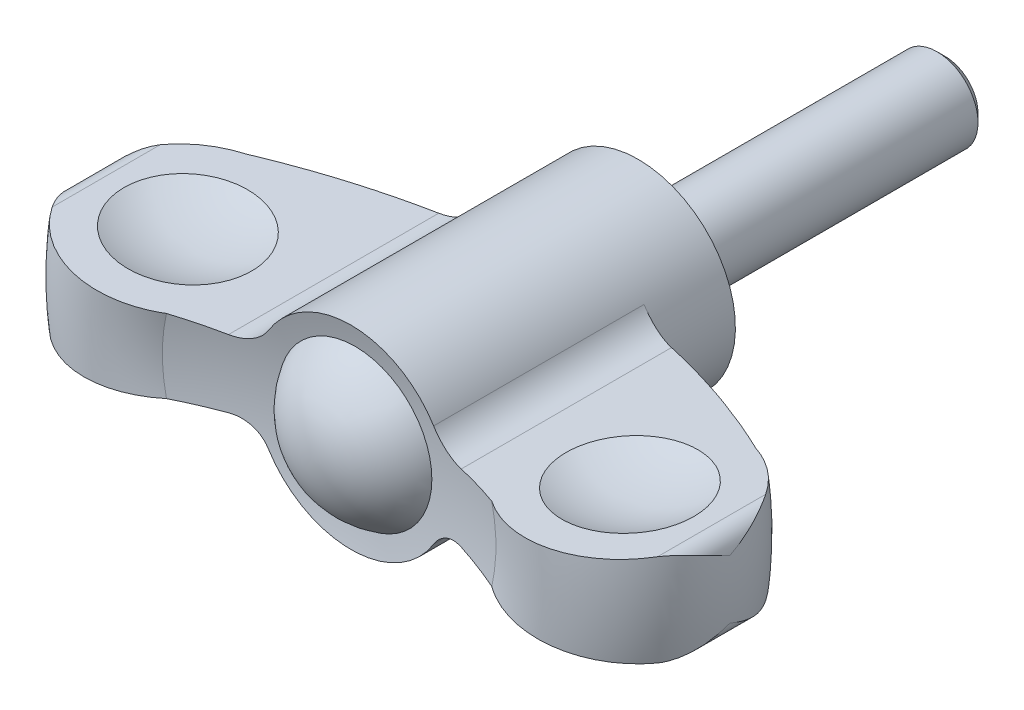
ISO-10303-21;
HEADER;
FILE_DESCRIPTION(('STEP AP214'),'2;1');
FILE_NAME('part.step','',(''),(''),'','','');
FILE_SCHEMA(('AUTOMOTIVE_DESIGN { 1 0 10303 214 1 1 1 1 }'));
ENDSEC;
DATA;
#1=APPLICATION_CONTEXT('core data for automotive mechanical design processes');
#2=APPLICATION_PROTOCOL_DEFINITION('international standard','automotive_design',2000,#1);
#3=PRODUCT_CONTEXT('',#1,'mechanical');
#4=PRODUCT('Part','Part','',(#3));
#5=PRODUCT_RELATED_PRODUCT_CATEGORY('part','',(#4));
#6=PRODUCT_DEFINITION_FORMATION('','',#4);
#7=PRODUCT_DEFINITION_CONTEXT('part definition',#1,'design');
#8=PRODUCT_DEFINITION('design','',#6,#7);
#9=PRODUCT_DEFINITION_SHAPE('','',#8);
#10=(LENGTH_UNIT() NAMED_UNIT(*) SI_UNIT(.MILLI.,.METRE.));
#11=(NAMED_UNIT(*) PLANE_ANGLE_UNIT() SI_UNIT($,.RADIAN.));
#12=(NAMED_UNIT(*) SI_UNIT($,.STERADIAN.) SOLID_ANGLE_UNIT());
#13=UNCERTAINTY_MEASURE_WITH_UNIT(LENGTH_MEASURE(1.E-05),#10,'distance_accuracy_value','');
#14=(GEOMETRIC_REPRESENTATION_CONTEXT(3) GLOBAL_UNCERTAINTY_ASSIGNED_CONTEXT((#13)) GLOBAL_UNIT_ASSIGNED_CONTEXT((#10,
#11,#12)) REPRESENTATION_CONTEXT('',''));
#15=CARTESIAN_POINT('',(0.,0.,0.));
#16=DIRECTION('',(0.,0.,1.));
#17=DIRECTION('',(1.,0.,0.));
#18=AXIS2_PLACEMENT_3D('',#15,#16,#17);
#19=CARTESIAN_POINT('',(0.,0.,76.6132216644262));
#20=DIRECTION('',(0.,0.,1.));
#21=DIRECTION('',(0.,1.,0.));
#22=AXIS2_PLACEMENT_3D('',#19,#20,#21);
#23=DEGENERATE_TOROIDAL_SURFACE('',#22,7.41274216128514,71.1525000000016,.F.);
#24=CARTESIAN_POINT('',(0.,0.,7.5));
#25=DIRECTION('',(0.,0.,1.));
#26=DIRECTION('',(0.,1.,0.));
#27=AXIS2_PLACEMENT_3D('',#24,#25,#26);
#28=CIRCLE('',#27,9.5);
#29=CARTESIAN_POINT('',(8.07537706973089,-5.00382705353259,7.5));
#30=VERTEX_POINT('',#29);
#31=CARTESIAN_POINT('',(8.07537711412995,5.0038269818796,7.5));
#32=VERTEX_POINT('',#31);
#33=EDGE_CURVE('E157',#30,#32,#28,.T.);
#34=ORIENTED_EDGE('',*,*,#33,.T.);
#35=CARTESIAN_POINT('',(8.07525319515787,5.00402698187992,7.50000000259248));
#36=CARTESIAN_POINT('',(8.12665454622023,4.92103773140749,7.49999174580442));
#37=CARTESIAN_POINT('',(8.18144861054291,4.84015820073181,7.50133541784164));
#38=CARTESIAN_POINT('',(8.29736182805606,4.68318005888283,7.50668034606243));
#39=CARTESIAN_POINT('',(8.35847989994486,4.607080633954,7.51068114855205));
#40=CARTESIAN_POINT('',(8.48644181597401,4.46037528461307,7.52128110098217));
#41=CARTESIAN_POINT('',(8.55327127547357,4.38975636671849,7.52787386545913));
#42=CARTESIAN_POINT('',(8.69224302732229,4.25429556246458,7.54356393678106));
#43=CARTESIAN_POINT('',(8.76438537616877,4.18945373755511,7.55266127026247));
#44=CARTESIAN_POINT('',(8.98795756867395,4.00427129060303,7.58354719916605));
#45=CARTESIAN_POINT('',(9.14667405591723,3.89311211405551,7.60894168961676));
#46=CARTESIAN_POINT('',(9.4786404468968,3.69815734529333,7.66816076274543));
#47=CARTESIAN_POINT('',(9.65189888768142,3.61437796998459,7.70199032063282));
#48=CARTESIAN_POINT('',(10.0125625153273,3.47403571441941,7.77763329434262));
#49=CARTESIAN_POINT('',(10.2002114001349,3.41819606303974,7.8196232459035));
#50=CARTESIAN_POINT('',(10.5805892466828,3.33774343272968,7.90948197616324));
#51=CARTESIAN_POINT('',(10.7733131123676,3.31310026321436,7.95734502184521));
#52=CARTESIAN_POINT('',(11.033653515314,3.30081513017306,8.02491673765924));
#53=CARTESIAN_POINT('',(11.1013248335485,3.29954054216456,8.04274730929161));
#54=CARTESIAN_POINT('',(11.236373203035,3.30079631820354,8.07885369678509));
#55=CARTESIAN_POINT('',(11.3037505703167,3.30331932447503,8.09712858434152));
#56=CARTESIAN_POINT('',(11.3709729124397,3.30772213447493,8.11561851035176));
#57=B_SPLINE_CURVE_WITH_KNOTS('',3,(#35,#36,#37,#38,#39,#40,#41,#42,#43,#44,#45,#46,#47,#48,#49,
#50,#51,#52,#53,#54,#55,#56),.UNSPECIFIED.,.F.,.F.,(4,2,2,2,2,2,2,2,2,2,4),(0.,
0.292752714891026,0.585455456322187,0.87744157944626,1.16943080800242,1.75277206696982,
2.33645821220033,2.93455895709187,3.53208044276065,3.74198071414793,3.95147483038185),.UNSPECIFIED.);
#58=CARTESIAN_POINT('',(11.3707729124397,3.30770903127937,8.11556349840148));
#59=VERTEX_POINT('',#58);
#60=EDGE_CURVE('E251',#32,#59,#57,.T.);
#61=ORIENTED_EDGE('',*,*,#60,.T.);
#62=CARTESIAN_POINT('',(24.9191403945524,4.19496480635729,13.4109144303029));
#63=CARTESIAN_POINT('',(23.8381391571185,4.12417217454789,12.8535823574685));
#64=CARTESIAN_POINT('',(22.7428134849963,4.05244146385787,12.324205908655));
#65=CARTESIAN_POINT('',(20.5293345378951,3.90748510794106,11.3241128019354));
#66=CARTESIAN_POINT('',(19.4112500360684,3.83426396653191,10.8532432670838));
#67=CARTESIAN_POINT('',(17.1522467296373,3.68632631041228,9.96991193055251));
#68=CARTESIAN_POINT('',(16.0113274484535,3.61160976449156,9.55745134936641));
#69=CARTESIAN_POINT('',(14.2836536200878,3.49846782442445,8.98318373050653));
#70=CARTESIAN_POINT('',(13.7042390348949,3.46052310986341,8.79894257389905));
#71=CARTESIAN_POINT('',(12.5407906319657,3.38433117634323,8.44572577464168));
#72=CARTESIAN_POINT('',(11.956756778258,3.34608395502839,8.27675025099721));
#73=CARTESIAN_POINT('',(11.3705729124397,3.30769593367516,8.11550848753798));
#74=B_SPLINE_CURVE_WITH_KNOTS('',3,(#62,#63,#64,#65,#66,#67,#68,#69,#70,#71,#72,#73),
.UNSPECIFIED.,.F.,.F.,(4,2,2,2,2,4),(0.,3.65437061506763,7.29898215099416,10.9436698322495,
12.771042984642,14.5984303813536),.UNSPECIFIED.);
#75=CARTESIAN_POINT('',(24.9187524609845,4.19493940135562,13.4107144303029));
#76=VERTEX_POINT('',#75);
#77=EDGE_CURVE('E242',#76,#59,#74,.T.);
#78=ORIENTED_EDGE('',*,*,#77,.F.);
#79=CARTESIAN_POINT('',(0.,0.,13.4107144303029));
#80=DIRECTION('',(0.,0.,1.));
#81=DIRECTION('',(0.,1.,0.));
#82=AXIS2_PLACEMENT_3D('',#79,#80,#81);
#83=CIRCLE('',#82,25.2693834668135);
#84=CARTESIAN_POINT('',(24.9187524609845,-4.19493940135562,13.4107144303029));
#85=VERTEX_POINT('',#84);
#86=EDGE_CURVE('E402',#85,#76,#83,.T.);
#87=ORIENTED_EDGE('',*,*,#86,.F.);
#88=CARTESIAN_POINT('',(11.3705729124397,-3.30769593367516,8.11550848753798));
#89=CARTESIAN_POINT('',(13.3194357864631,-3.43532310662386,8.65165350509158));
#90=CARTESIAN_POINT('',(15.2454387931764,-3.56145323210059,9.27335320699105));
#91=CARTESIAN_POINT('',(19.0285581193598,-3.80920223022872,10.6774595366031));
#92=CARTESIAN_POINT('',(20.8859409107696,-3.93083855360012,11.4591449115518));
#93=CARTESIAN_POINT('',(23.0778618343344,-4.07438311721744,12.4939591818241));
#94=CARTESIAN_POINT('',(23.4481408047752,-4.09863195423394,12.6727423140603));
#95=CARTESIAN_POINT('',(24.1858660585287,-4.14694412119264,13.0369148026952));
#96=CARTESIAN_POINT('',(24.5533094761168,-4.1710072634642,13.2223099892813));
#97=CARTESIAN_POINT('',(24.9191403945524,-4.19496480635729,13.4109144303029));
#98=B_SPLINE_CURVE_WITH_KNOTS('',3,(#88,#89,#90,#91,#92,#93,#94,#95,#96,#97),.UNSPECIFIED.,.F.,
.F.,(4,2,2,2,4),(0.,6.07517314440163,12.1235385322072,13.3591937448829,14.5959668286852),.UNSPECIFIED.);
#99=CARTESIAN_POINT('',(11.3707729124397,-3.30770903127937,8.11556349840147));
#100=VERTEX_POINT('',#99);
#101=EDGE_CURVE('E232',#100,#85,#98,.T.);
#102=ORIENTED_EDGE('',*,*,#101,.F.);
#103=CARTESIAN_POINT('',(11.3709729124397,-3.30772213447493,8.11561851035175));
#104=CARTESIAN_POINT('',(11.2701325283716,-3.30110509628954,8.08788118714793));
#105=CARTESIAN_POINT('',(11.1688817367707,-3.29874082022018,8.06061250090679));
#106=CARTESIAN_POINT('',(10.9662236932,-3.3025707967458,8.00721735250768));
#107=CARTESIAN_POINT('',(10.86481641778,-3.30876648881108,7.98109108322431));
#108=CARTESIAN_POINT('',(10.6624409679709,-3.32978238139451,7.93016922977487));
#109=CARTESIAN_POINT('',(10.5614733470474,-3.34461137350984,7.90537503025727));
#110=CARTESIAN_POINT('',(10.3608328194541,-3.38287019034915,7.85737208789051));
#111=CARTESIAN_POINT('',(10.2611598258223,-3.40629943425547,7.83416323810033));
#112=CARTESIAN_POINT('',(9.96486870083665,-3.48949811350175,7.76717843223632));
#113=CARTESIAN_POINT('',(9.77109378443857,-3.56216663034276,7.72607333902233));
#114=CARTESIAN_POINT('',(9.39755022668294,-3.74054378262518,7.65286990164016));
#115=CARTESIAN_POINT('',(9.21777675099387,-3.84624095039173,7.62076843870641));
#116=CARTESIAN_POINT('',(8.96611052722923,-4.02532517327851,7.58103605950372));
#117=CARTESIAN_POINT('',(8.88646307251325,-4.08719630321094,7.56933067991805));
#118=CARTESIAN_POINT('',(8.73245596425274,-4.21758210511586,7.54853793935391));
#119=CARTESIAN_POINT('',(8.65809406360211,-4.28609392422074,7.53944946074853));
#120=CARTESIAN_POINT('',(8.51538277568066,-4.42916784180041,7.52402786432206));
#121=CARTESIAN_POINT('',(8.44702397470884,-4.50372010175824,7.51769036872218));
#122=CARTESIAN_POINT('',(8.31677244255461,-4.65839173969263,7.50784180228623));
#123=CARTESIAN_POINT('',(8.25487550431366,-4.73850743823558,7.50432888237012));
#124=CARTESIAN_POINT('',(8.1753277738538,-4.85096452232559,7.50150027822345));
#125=CARTESIAN_POINT('',(8.15464683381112,-4.88116885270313,7.50093670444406));
#126=CARTESIAN_POINT('',(8.11423881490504,-4.94215928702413,7.50018643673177));
#127=CARTESIAN_POINT('',(8.09451057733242,-4.97294461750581,7.49999927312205));
#128=CARTESIAN_POINT('',(8.07525315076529,-5.00402705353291,7.50000000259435));
#129=B_SPLINE_CURVE_WITH_KNOTS('',3,(#103,#104,#105,#106,#107,#108,#109,#110,#111,#112,#113,
#114,#115,#116,#117,#118,#119,#120,#121,#122,#123,#124,#125,#126,#127,#128),.UNSPECIFIED.,.F.,
.F.,(4,2,2,2,2,2,2,2,2,2,2,2,4),(0.,0.314298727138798,0.628650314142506,0.943322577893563,
1.25797359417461,1.88762970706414,2.51706744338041,2.82134305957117,3.12548853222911,
3.42914821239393,3.73260894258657,3.8424257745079,3.95210549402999),.UNSPECIFIED.);
#130=EDGE_CURVE('E222',#100,#30,#129,.T.);
#131=ORIENTED_EDGE('',*,*,#130,.T.);
#132=EDGE_LOOP('',(#34,#61,#78,#87,#102,#131));
#133=FACE_BOUND('',#132,.T.);
#134=ADVANCED_FACE('F14',(#133),#23,.F.);
#135=CARTESIAN_POINT('',(0.,0.,22.4));
#136=DIRECTION('',(0.,0.,1.));
#137=DIRECTION('',(0.,1.,0.));
#138=AXIS2_PLACEMENT_3D('',#135,#136,#137);
#139=TOROIDAL_SURFACE('',#138,21.9,9.6);
#140=CARTESIAN_POINT('',(-18.1474454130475,-3.75149990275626,13.4105144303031));
#141=CARTESIAN_POINT('',(-17.8905850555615,-3.73467862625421,13.5060281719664));
#142=CARTESIAN_POINT('',(-17.6377608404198,-3.71812166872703,13.6124268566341));
#143=CARTESIAN_POINT('',(-17.1419285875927,-3.68565059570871,13.8461211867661));
#144=CARTESIAN_POINT('',(-16.8989202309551,-3.66973645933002,13.9734161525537));
#145=CARTESIAN_POINT('',(-16.4245099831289,-3.63866827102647,14.2479997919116));
#146=CARTESIAN_POINT('',(-16.1931050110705,-3.62351401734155,14.3952831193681));
#147=CARTESIAN_POINT('',(-15.743480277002,-3.59406898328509,14.7088327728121));
#148=CARTESIAN_POINT('',(-15.5252603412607,-3.57977819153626,14.8750988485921));
#149=CARTESIAN_POINT('',(-15.1034606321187,-3.55215536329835,15.2255617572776));
#150=CARTESIAN_POINT('',(-14.8998888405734,-3.53882384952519,15.4097682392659));
#151=CARTESIAN_POINT('',(-14.5090032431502,-3.51322552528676,15.794766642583));
#152=CARTESIAN_POINT('',(-14.321689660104,-3.50095872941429,15.9955587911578));
#153=CARTESIAN_POINT('',(-13.9647725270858,-3.4775849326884,16.4122828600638));
#154=CARTESIAN_POINT('',(-13.7951642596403,-3.46647762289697,16.6282107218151));
#155=CARTESIAN_POINT('',(-13.4749045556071,-3.44550444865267,17.073751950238));
#156=CARTESIAN_POINT('',(-13.3242529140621,-3.43563857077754,17.3033651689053));
#157=CARTESIAN_POINT('',(-13.0439598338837,-3.41728273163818,17.7732237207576));
#158=CARTESIAN_POINT('',(-12.9141954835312,-3.40878472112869,18.0133954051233));
#159=CARTESIAN_POINT('',(-12.6756273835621,-3.39316136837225,18.5039680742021));
#160=CARTESIAN_POINT('',(-12.5668227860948,-3.38603597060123,18.7543686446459));
#161=CARTESIAN_POINT('',(-12.3710778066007,-3.37321701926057,19.2636307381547));
#162=CARTESIAN_POINT('',(-12.2841387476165,-3.36752355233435,19.5224927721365));
#163=CARTESIAN_POINT('',(-12.1328924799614,-3.35761873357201,20.0467739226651));
#164=CARTESIAN_POINT('',(-12.0685848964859,-3.35340735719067,20.3121929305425));
#165=CARTESIAN_POINT('',(-11.9641647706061,-3.34656908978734,20.842606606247));
#166=CARTESIAN_POINT('',(-11.9236219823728,-3.34391402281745,21.1075162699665));
#167=CARTESIAN_POINT('',(-11.8652424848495,-3.34009086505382,21.6398358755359));
#168=CARTESIAN_POINT('',(-11.8474054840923,-3.33892275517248,21.9072457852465));
#169=CARTESIAN_POINT('',(-11.8345982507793,-3.33808403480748,22.4425774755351));
#170=CARTESIAN_POINT('',(-11.8396248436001,-3.33841321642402,22.7104991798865));
#171=CARTESIAN_POINT('',(-11.8724923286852,-3.34056564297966,23.2449323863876));
#172=CARTESIAN_POINT('',(-11.9003331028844,-3.34238888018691,23.5114438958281));
#173=CARTESIAN_POINT('',(-11.9780680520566,-3.34747958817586,24.0376567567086));
#174=CARTESIAN_POINT('',(-12.027669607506,-3.35072789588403,24.2974015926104));
#175=CARTESIAN_POINT('',(-12.1484267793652,-3.35863604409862,24.811805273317));
#176=CARTESIAN_POINT('',(-12.2195821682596,-3.36329586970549,25.0664641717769));
#177=CARTESIAN_POINT('',(-12.3828443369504,-3.37398758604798,25.5689078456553));
#178=CARTESIAN_POINT('',(-12.4749485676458,-3.38001930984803,25.8166934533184));
#179=CARTESIAN_POINT('',(-12.679407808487,-3.39340894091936,26.3038316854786));
#180=CARTESIAN_POINT('',(-12.7917703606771,-3.40076734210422,26.543181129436));
#181=CARTESIAN_POINT('',(-13.0369078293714,-3.41682090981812,27.0137884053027));
#182=CARTESIAN_POINT('',(-13.1698514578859,-3.42552712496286,27.2449579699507));
#183=CARTESIAN_POINT('',(-13.4544154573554,-3.44416265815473,27.6954567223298));
#184=CARTESIAN_POINT('',(-13.6060365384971,-3.45409202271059,27.9147854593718));
#185=CARTESIAN_POINT('',(-13.9268367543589,-3.47510059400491,28.3401572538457));
#186=CARTESIAN_POINT('',(-14.0960166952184,-3.48617985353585,28.5461997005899));
#187=CARTESIAN_POINT('',(-14.4507138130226,-3.50940826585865,28.9436423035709));
#188=CARTESIAN_POINT('',(-14.6362312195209,-3.52155743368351,29.1350422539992));
#189=CARTESIAN_POINT('',(-15.0260268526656,-3.54708437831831,29.5054914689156));
#190=CARTESIAN_POINT('',(-15.2305978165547,-3.56048132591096,29.6842314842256));
#191=CARTESIAN_POINT('',(-15.6538967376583,-3.58820233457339,30.0239900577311));
#192=CARTESIAN_POINT('',(-15.8726245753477,-3.6025263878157,30.1850087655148));
#193=CARTESIAN_POINT('',(-16.322752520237,-3.63200437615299,30.4882695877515));
#194=CARTESIAN_POINT('',(-16.5541555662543,-3.6471585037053,30.6305073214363));
#195=CARTESIAN_POINT('',(-17.0278914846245,-3.67818253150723,30.8951425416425));
#196=CARTESIAN_POINT('',(-17.2702206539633,-3.69405218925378,31.017546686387));
#197=CARTESIAN_POINT('',(-17.7669669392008,-3.72658312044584,31.2429802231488));
#198=CARTESIAN_POINT('',(-18.0214889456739,-3.74325126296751,31.3457775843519));
#199=CARTESIAN_POINT('',(-18.538265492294,-3.77709393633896,31.5295393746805));
#200=CARTESIAN_POINT('',(-18.8005200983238,-3.79426847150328,31.6105036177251));
#201=CARTESIAN_POINT('',(-19.3309113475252,-3.82900274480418,31.7500060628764));
#202=CARTESIAN_POINT('',(-19.5990481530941,-3.84656249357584,31.8085436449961));
#203=CARTESIAN_POINT('',(-20.1392890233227,-3.88194179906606,31.9027453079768));
#204=CARTESIAN_POINT('',(-20.4113930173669,-3.89976135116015,31.9384097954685));
#205=CARTESIAN_POINT('',(-20.9576381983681,-3.93553386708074,31.9865808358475));
#206=CARTESIAN_POINT('',(-21.2317794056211,-3.95348683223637,31.9990871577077));
#207=CARTESIAN_POINT('',(-21.7801364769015,-3.98939765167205,32.0008164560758));
#208=CARTESIAN_POINT('',(-22.0543523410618,-4.00735550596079,31.9900393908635));
#209=CARTESIAN_POINT('',(-22.6008596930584,-4.04314519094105,31.9452447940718));
#210=CARTESIAN_POINT('',(-22.8731513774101,-4.06097703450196,31.9112296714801));
#211=CARTESIAN_POINT('',(-23.4138724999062,-4.09638779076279,31.8201695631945));
#212=CARTESIAN_POINT('',(-23.6823019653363,-4.1139667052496,31.7631247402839));
#213=CARTESIAN_POINT('',(-24.2118784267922,-4.14864761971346,31.6267614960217));
#214=CARTESIAN_POINT('',(-24.4730575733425,-4.16575172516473,31.547568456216));
#215=CARTESIAN_POINT('',(-24.987795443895,-4.19946088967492,31.3673123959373));
#216=CARTESIAN_POINT('',(-25.2413540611,-4.2160659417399,31.2662490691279));
#217=CARTESIAN_POINT('',(-25.7391278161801,-4.24866415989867,31.0428965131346));
#218=CARTESIAN_POINT('',(-25.9833385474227,-4.26465703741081,30.9205974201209));
#219=CARTESIAN_POINT('',(-26.4605066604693,-4.29590583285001,30.655664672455));
#220=CARTESIAN_POINT('',(-26.6934645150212,-4.31116178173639,30.5130318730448));
#221=CARTESIAN_POINT('',(-27.1452633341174,-4.34074919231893,30.2092249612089));
#222=CARTESIAN_POINT('',(-27.3641711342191,-4.35508503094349,30.0481506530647));
#223=CARTESIAN_POINT('',(-27.7875859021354,-4.38281362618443,29.7080080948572));
#224=CARTESIAN_POINT('',(-27.9920934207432,-4.39620641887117,29.5289405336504));
#225=CARTESIAN_POINT('',(-28.3848624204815,-4.42192808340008,29.1544313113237));
#226=CARTESIAN_POINT('',(-28.5731528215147,-4.43425884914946,28.9590200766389));
#227=CARTESIAN_POINT('',(-28.9324617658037,-4.45778928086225,28.5530043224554));
#228=CARTESIAN_POINT('',(-29.1034908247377,-4.4689896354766,28.3424091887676));
#229=CARTESIAN_POINT('',(-29.319374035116,-4.48312739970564,28.0522910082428));
#230=CARTESIAN_POINT('',(-29.3724491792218,-4.48660318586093,27.9788119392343));
#231=CARTESIAN_POINT('',(-29.4764415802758,-4.49341344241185,27.8304567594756));
#232=CARTESIAN_POINT('',(-29.5273611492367,-4.49674806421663,27.7555822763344));
#233=CARTESIAN_POINT('',(-29.5772181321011,-4.50001309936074,27.679991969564));
#234=B_SPLINE_CURVE_WITH_KNOTS('',3,(#140,#141,#142,#143,#144,#145,#146,#147,#148,#149,#150,
#151,#152,#153,#154,#155,#156,#157,#158,#159,#160,#161,#162,#163,#164,#165,#166,#167,#168,#169,
#170,#171,#172,#173,#174,#175,#176,#177,#178,#179,#180,#181,#182,#183,#184,#185,#186,#187,#188,
#189,#190,#191,#192,#193,#194,#195,#196,#197,#198,#199,#200,#201,#202,#203,#204,#205,#206,#207,
#208,#209,#210,#211,#212,#213,#214,#215,#216,#217,#218,#219,#220,#221,#222,#223,#224,#225,#226,
#227,#228,#229,#230,#231,#232,#233),.UNSPECIFIED.,.F.,.F.,(4,2,2,2,2,2,2,2,2,2,2,2,2,2,2,2,2,2,
2,2,2,2,2,2,2,2,2,2,2,2,2,2,2,2,2,2,2,2,2,2,2,2,2,2,2,2,4),(0.,0.82342903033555,
1.64683128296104,2.47001373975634,3.29318534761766,4.11680216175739,4.9404302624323,
5.76383834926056,6.58723753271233,7.40559872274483,8.22392680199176,9.04230438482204,
9.86066841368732,10.6637182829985,11.4667578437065,12.2696859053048,13.0726098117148,
13.8650526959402,14.6574872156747,15.449825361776,16.2424591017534,17.0419728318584,
17.8415169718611,18.6410978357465,19.4406899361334,20.2556974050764,21.0706979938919,
21.8858883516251,22.7008044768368,23.5248358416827,24.3488742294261,25.1729353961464,
25.9969819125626,26.8210366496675,27.6450928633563,28.469063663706,29.2930286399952,
30.1124203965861,30.9318236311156,31.7516084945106,32.5713588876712,33.3868657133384,
34.2023413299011,35.0163312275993,35.8298222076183,36.1019244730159,36.3737270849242),.UNSPECIFIED.);
#235=CARTESIAN_POINT('',(-15.8916566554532,-3.60377276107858,30.1939503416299));
#236=VERTEX_POINT('',#235);
#237=CARTESIAN_POINT('',(-29.5770181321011,-4.5,27.6802951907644));
#238=VERTEX_POINT('',#237);
#239=EDGE_CURVE('E276',#236,#238,#234,.T.);
#240=ORIENTED_EDGE('',*,*,#239,.F.);
#241=CARTESIAN_POINT('',(0.,0.,30.1939503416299));
#242=DIRECTION('',(0.,0.,1.));
#243=DIRECTION('',(0.,1.,0.));
#244=AXIS2_PLACEMENT_3D('',#241,#242,#243);
#245=CIRCLE('',#244,16.2951504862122);
#246=CARTESIAN_POINT('',(-15.8916566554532,3.60377276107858,30.1939503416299));
#247=VERTEX_POINT('',#246);
#248=EDGE_CURVE('E210',#247,#236,#245,.T.);
#249=ORIENTED_EDGE('',*,*,#248,.F.);
#250=CARTESIAN_POINT('',(-29.577218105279,4.50001309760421,27.6799920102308));
#251=CARTESIAN_POINT('',(-29.4283813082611,4.49026607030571,27.9057071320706));
#252=CARTESIAN_POINT('',(-29.2699701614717,4.47989203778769,28.1250732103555));
#253=CARTESIAN_POINT('',(-28.9352574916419,4.45797236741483,28.5496181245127));
#254=CARTESIAN_POINT('',(-28.7589571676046,4.44642680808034,28.7547979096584));
#255=CARTESIAN_POINT('',(-28.3898682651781,4.42225590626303,29.1493363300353));
#256=CARTESIAN_POINT('',(-28.1970944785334,4.40963153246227,29.3387088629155));
#257=CARTESIAN_POINT('',(-27.7963194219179,4.38338556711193,29.7005094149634));
#258=CARTESIAN_POINT('',(-27.5883182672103,4.3697639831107,29.872937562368));
#259=CARTESIAN_POINT('',(-27.1584989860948,4.34161596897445,30.199703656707));
#260=CARTESIAN_POINT('',(-26.9366758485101,4.32708921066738,30.3540349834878));
#261=CARTESIAN_POINT('',(-26.4808650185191,4.29723906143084,30.6434656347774));
#262=CARTESIAN_POINT('',(-26.2468771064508,4.28191565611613,30.7785646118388));
#263=CARTESIAN_POINT('',(-25.7684462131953,4.25058416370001,31.0285776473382));
#264=CARTESIAN_POINT('',(-25.5240048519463,4.23457618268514,31.1434948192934));
#265=CARTESIAN_POINT('',(-25.0263706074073,4.20198710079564,31.3523874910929));
#266=CARTESIAN_POINT('',(-24.773177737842,4.1854060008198,31.4463630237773));
#267=CARTESIAN_POINT('',(-24.2590478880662,4.15173665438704,31.6129966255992));
#268=CARTESIAN_POINT('',(-23.9980896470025,4.13464701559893,31.685588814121));
#269=CARTESIAN_POINT('',(-23.4709078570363,4.10012292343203,31.8086173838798));
#270=CARTESIAN_POINT('',(-23.2046821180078,4.08268832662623,31.8590443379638));
#271=CARTESIAN_POINT('',(-22.6689091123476,4.04760161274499,31.9373839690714));
#272=CARTESIAN_POINT('',(-22.3993613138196,4.0299494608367,31.9652929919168));
#273=CARTESIAN_POINT('',(-21.8589964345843,3.99456203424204,31.9984159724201));
#274=CARTESIAN_POINT('',(-21.5881799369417,3.97682679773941,32.0036394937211));
#275=CARTESIAN_POINT('',(-21.0454404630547,3.94128386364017,31.9913795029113));
#276=CARTESIAN_POINT('',(-20.7735205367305,3.9234763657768,31.9737602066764));
#277=CARTESIAN_POINT('',(-20.2321124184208,3.88802061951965,31.9157373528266));
#278=CARTESIAN_POINT('',(-19.9626242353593,3.8703723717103,31.8753337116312));
#279=CARTESIAN_POINT('',(-19.4280257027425,3.83536257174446,31.7720671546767));
#280=CARTESIAN_POINT('',(-19.1629144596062,3.81800096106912,31.7092088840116));
#281=CARTESIAN_POINT('',(-18.6387730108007,3.78367597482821,31.5614710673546));
#282=CARTESIAN_POINT('',(-18.3797450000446,3.76671274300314,31.4765837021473));
#283=CARTESIAN_POINT('',(-17.8682212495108,3.73321406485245,31.2848646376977));
#284=CARTESIAN_POINT('',(-17.6157711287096,3.71668160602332,31.177910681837));
#285=CARTESIAN_POINT('',(-17.1207307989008,3.6842623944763,30.9431230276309));
#286=CARTESIAN_POINT('',(-16.8781406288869,3.66837564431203,30.8152892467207));
#287=CARTESIAN_POINT('',(-16.4045275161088,3.63735965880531,30.5396362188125));
#288=CARTESIAN_POINT('',(-16.1735051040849,3.62223045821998,30.3918160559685));
#289=CARTESIAN_POINT('',(-15.7246794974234,3.59283775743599,30.0772205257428));
#290=CARTESIAN_POINT('',(-15.5068766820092,3.57857428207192,29.9104446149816));
#291=CARTESIAN_POINT('',(-15.0856203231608,3.55098703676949,29.5587225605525));
#292=CARTESIAN_POINT('',(-14.8821981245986,3.53766531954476,29.3737387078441));
#293=CARTESIAN_POINT('',(-14.4917116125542,3.51209313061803,28.9871837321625));
#294=CARTESIAN_POINT('',(-14.3046468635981,3.49984263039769,28.7856130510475));
#295=CARTESIAN_POINT('',(-13.9482722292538,3.47650436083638,28.3672761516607));
#296=CARTESIAN_POINT('',(-13.7789624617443,3.46541659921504,28.1505098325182));
#297=CARTESIAN_POINT('',(-13.4594078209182,3.4444895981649,27.7032976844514));
#298=CARTESIAN_POINT('',(-13.3091625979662,3.43465033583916,27.4728521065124));
#299=CARTESIAN_POINT('',(-13.0300075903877,3.4163690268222,27.0017206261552));
#300=CARTESIAN_POINT('',(-12.9009427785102,3.40791682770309,26.7611269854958));
#301=CARTESIAN_POINT('',(-12.6638563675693,3.39239050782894,26.269856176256));
#302=CARTESIAN_POINT('',(-12.5558264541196,3.38531584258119,26.0191830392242));
#303=CARTESIAN_POINT('',(-12.3616487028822,3.37259952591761,25.5094385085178));
#304=CARTESIAN_POINT('',(-12.2755026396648,3.36695799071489,25.2503664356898));
#305=CARTESIAN_POINT('',(-12.125856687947,3.35715797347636,24.7257346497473));
#306=CARTESIAN_POINT('',(-12.0623564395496,3.35299946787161,24.4601750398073));
#307=CARTESIAN_POINT('',(-11.9595441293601,3.34626649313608,23.9295575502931));
#308=CARTESIAN_POINT('',(-11.9198013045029,3.34366381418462,23.6645834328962));
#309=CARTESIAN_POINT('',(-11.8630211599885,3.33994539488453,23.1322038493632));
#310=CARTESIAN_POINT('',(-11.8459835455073,3.33882963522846,22.8647984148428));
#311=CARTESIAN_POINT('',(-11.8347668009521,3.33809507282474,22.3295252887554));
#312=CARTESIAN_POINT('',(-11.8405860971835,3.33847616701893,22.0616576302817));
#313=CARTESIAN_POINT('',(-11.8750272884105,3.34073165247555,21.5273997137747));
#314=CARTESIAN_POINT('',(-11.9036490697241,3.34260603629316,21.2610094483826));
#315=CARTESIAN_POINT('',(-11.9829240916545,3.34779760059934,20.7350583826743));
#316=CARTESIAN_POINT('',(-12.033288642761,3.35109587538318,20.4754538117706));
#317=CARTESIAN_POINT('',(-12.1555550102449,3.35910285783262,19.961393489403));
#318=CARTESIAN_POINT('',(-12.2274566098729,3.36381155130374,19.7069376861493));
#319=CARTESIAN_POINT('',(-12.3921774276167,3.37459879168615,19.2049950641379));
#320=CARTESIAN_POINT('',(-12.4849912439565,3.38067698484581,18.9575064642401));
#321=CARTESIAN_POINT('',(-12.6908448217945,3.39415792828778,18.470999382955));
#322=CARTESIAN_POINT('',(-12.8038936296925,3.40156127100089,18.2319847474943));
#323=CARTESIAN_POINT('',(-13.050399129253,3.41770442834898,17.7620583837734));
#324=CARTESIAN_POINT('',(-13.1840279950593,3.42645551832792,17.5312373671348));
#325=CARTESIAN_POINT('',(-13.4698675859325,3.4451745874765,17.0815911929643));
#326=CARTESIAN_POINT('',(-13.6220707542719,3.45514207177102,16.8627612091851));
#327=CARTESIAN_POINT('',(-13.9440945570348,3.4762307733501,16.4382825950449));
#328=CARTESIAN_POINT('',(-14.113927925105,3.48735282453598,16.2326436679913));
#329=CARTESIAN_POINT('',(-14.4698944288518,3.51066436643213,15.836072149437));
#330=CARTESIAN_POINT('',(-14.6560271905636,3.52285383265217,15.6451392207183));
#331=CARTESIAN_POINT('',(-15.0471805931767,3.54846969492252,15.2755429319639));
#332=CARTESIAN_POINT('',(-15.2525053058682,3.56191600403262,15.097202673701));
#333=CARTESIAN_POINT('',(-15.6772923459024,3.58973446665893,14.7583242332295));
#334=CARTESIAN_POINT('',(-15.8967545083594,3.60410660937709,14.5977858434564));
#335=CARTESIAN_POINT('',(-16.3478939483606,3.63365083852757,14.2958496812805));
#336=CARTESIAN_POINT('',(-16.5795509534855,3.64882159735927,14.1544214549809));
#337=CARTESIAN_POINT('',(-17.0537037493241,3.67987292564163,13.8914238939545));
#338=CARTESIAN_POINT('',(-17.2961933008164,3.69575308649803,13.769843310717));
#339=CARTESIAN_POINT('',(-17.6425873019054,3.71843774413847,13.6138611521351));
#340=CARTESIAN_POINT('',(-17.7426773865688,3.7249924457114,13.5707938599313));
#341=CARTESIAN_POINT('',(-17.9441132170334,3.7381840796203,13.4880908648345));
#342=CARTESIAN_POINT('',(-18.045457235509,3.74482089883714,13.4484509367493));
#343=CARTESIAN_POINT('',(-18.1474454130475,3.75149990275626,13.4105144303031));
#344=B_SPLINE_CURVE_WITH_KNOTS('',3,(#250,#251,#252,#253,#254,#255,#256,#257,#258,#259,#260,
#261,#262,#263,#264,#265,#266,#267,#268,#269,#270,#271,#272,#273,#274,#275,#276,#277,#278,#279,
#280,#281,#282,#283,#284,#285,#286,#287,#288,#289,#290,#291,#292,#293,#294,#295,#296,#297,#298,
#299,#300,#301,#302,#303,#304,#305,#306,#307,#308,#309,#310,#311,#312,#313,#314,#315,#316,#317,
#318,#319,#320,#321,#322,#323,#324,#325,#326,#327,#328,#329,#330,#331,#332,#333,#334,#335,#336,
#337,#338,#339,#340,#341,#342,#343),.UNSPECIFIED.,.F.,.F.,(4,2,2,2,2,2,2,2,2,2,2,2,2,2,2,2,2,2,
2,2,2,2,2,2,2,2,2,2,2,2,2,2,2,2,2,2,2,2,2,2,2,2,2,2,2,2,4),(0.,0.811383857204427,
1.62271336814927,2.43332187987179,3.24392425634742,4.05482224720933,4.86573488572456,
5.67652231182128,6.48730846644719,7.30056707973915,8.11417124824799,8.92790742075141,
9.7413005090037,10.5595508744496,11.3778042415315,12.1958884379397,13.0142634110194,
13.8373004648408,14.6603407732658,15.4834188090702,16.3065204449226,17.1313641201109,
17.9561858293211,18.7810130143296,19.6058250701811,20.4243011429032,21.2424530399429,
22.0606712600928,22.8788764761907,23.6817568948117,24.4846268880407,25.2874416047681,
26.0902523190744,26.8827166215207,27.6751729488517,28.4674248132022,29.2600317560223,
30.0596712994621,30.8589865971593,31.658883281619,32.4587616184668,33.2746912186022,
34.090611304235,34.9052154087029,35.7193562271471,36.0467859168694,36.3738060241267),.UNSPECIFIED.);
#345=CARTESIAN_POINT('',(-29.577018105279,4.5,27.6802952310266));
#346=VERTEX_POINT('',#345);
#347=EDGE_CURVE('E298',#346,#247,#344,.T.);
#348=ORIENTED_EDGE('',*,*,#347,.F.);
#349=CARTESIAN_POINT('',(-31.369564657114,2.86363636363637,22.4));
#350=CARTESIAN_POINT('',(-31.3693228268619,2.86628559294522,22.4059654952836));
#351=CARTESIAN_POINT('',(-31.3690751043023,2.86893438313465,22.4119311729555));
#352=CARTESIAN_POINT('',(-31.3455550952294,3.11453943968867,22.9652019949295));
#353=CARTESIAN_POINT('',(-31.2727100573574,3.35362322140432,23.5139845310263));
#354=CARTESIAN_POINT('',(-31.0906514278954,3.68216340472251,24.3317563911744));
#355=CARTESIAN_POINT('',(-31.0177760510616,3.78670945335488,24.6035877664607));
#356=CARTESIAN_POINT('',(-30.8477677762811,3.98135441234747,25.1449637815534));
#357=CARTESIAN_POINT('',(-30.7506472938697,4.07146067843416,25.4145095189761));
#358=CARTESIAN_POINT('',(-30.5719332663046,4.20252900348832,25.8529322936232));
#359=CARTESIAN_POINT('',(-30.4974342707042,4.24947683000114,26.0229493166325));
#360=CARTESIAN_POINT('',(-30.3388744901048,4.33328283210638,26.3608778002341));
#361=CARTESIAN_POINT('',(-30.2548212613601,4.37014890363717,26.5287908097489));
#362=CARTESIAN_POINT('',(-30.0769796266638,4.43174329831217,26.8627513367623));
#363=CARTESIAN_POINT('',(-29.9831491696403,4.45641633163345,27.0287870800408));
#364=CARTESIAN_POINT('',(-29.8357178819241,4.48201227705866,27.2752518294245));
#365=CARTESIAN_POINT('',(-29.7853951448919,4.48864307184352,27.3570723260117));
#366=CARTESIAN_POINT('',(-29.6826484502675,4.4976362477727,27.5196657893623));
#367=CARTESIAN_POINT('',(-29.630223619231,4.49999683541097,27.6004383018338));
#368=CARTESIAN_POINT('',(-29.5768181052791,4.4999999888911,27.6805954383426));
#369=B_SPLINE_CURVE_WITH_KNOTS('',3,(#349,#350,#351,#352,#353,#354,#355,#356,#357,#358,#359,
#360,#361,#362,#363,#364,#365,#366,#367,#368),.UNSPECIFIED.,.F.,.F.,(4,2,2,2,2,2,2,2,2,4),(0.,
0.0195959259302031,1.81731826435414,2.71712331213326,3.61646852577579,4.19044381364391,
4.76396827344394,5.34007007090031,5.62881792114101,5.91768701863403),.UNSPECIFIED.);
#370=CARTESIAN_POINT('',(-31.369564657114,2.86363636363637,22.4));
#371=VERTEX_POINT('',#370);
#372=EDGE_CURVE('E360',#371,#346,#369,.T.);
#373=ORIENTED_EDGE('',*,*,#372,.F.);
#374=CARTESIAN_POINT('',(-29.576818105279,4.49999998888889,17.1194045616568));
#375=CARTESIAN_POINT('',(-29.619139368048,4.50000102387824,17.1829266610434));
#376=CARTESIAN_POINT('',(-29.6608485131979,4.49851722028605,17.2468391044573));
#377=CARTESIAN_POINT('',(-29.7429683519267,4.49280699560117,17.3753522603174));
#378=CARTESIAN_POINT('',(-29.7833793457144,4.48858121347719,17.4399528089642));
#379=CARTESIAN_POINT('',(-29.9024609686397,4.47214705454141,17.6344933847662));
#380=CARTESIAN_POINT('',(-29.9791105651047,4.45618046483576,17.765367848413));
#381=CARTESIAN_POINT('',(-30.1263186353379,4.41582925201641,18.0284830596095));
#382=CARTESIAN_POINT('',(-30.1969002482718,4.39147855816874,18.1607162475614));
#383=CARTESIAN_POINT('',(-30.3321494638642,4.33558288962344,18.4267422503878));
#384=CARTESIAN_POINT('',(-30.3968138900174,4.30403408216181,18.5605358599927));
#385=CARTESIAN_POINT('',(-30.5626786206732,4.21088535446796,18.9222641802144));
#386=CARTESIAN_POINT('',(-30.6582400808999,4.1435864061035,19.1513508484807));
#387=CARTESIAN_POINT('',(-30.8316829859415,3.99568952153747,19.6118454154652));
#388=CARTESIAN_POINT('',(-30.9095558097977,3.91508513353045,19.8432543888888));
#389=CARTESIAN_POINT('',(-31.1166837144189,3.65806718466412,20.540705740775));
#390=CARTESIAN_POINT('',(-31.219251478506,3.46657224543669,21.009542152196));
#391=CARTESIAN_POINT('',(-31.3069727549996,3.20184757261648,21.6292554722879));
#392=CARTESIAN_POINT('',(-31.3245600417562,3.13661935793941,21.7798368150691));
#393=CARTESIAN_POINT('',(-31.3522803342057,3.00489991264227,22.080989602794));
#394=CARTESIAN_POINT('',(-31.3624220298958,2.93841024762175,22.2315608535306));
#395=CARTESIAN_POINT('',(-31.3690750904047,2.86893445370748,22.3880686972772));
#396=CARTESIAN_POINT('',(-31.3693228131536,2.86628566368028,22.3940343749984));
#397=CARTESIAN_POINT('',(-31.369564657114,2.86363636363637,22.4));
#398=B_SPLINE_CURVE_WITH_KNOTS('',3,(#374,#375,#376,#377,#378,#379,#380,#381,#382,#383,#384,
#385,#386,#387,#388,#389,#390,#391,#392,#393,#394,#395,#396,#397),.UNSPECIFIED.,.F.,.F.,(4,2,2,
2,2,2,2,2,2,2,2,4),(0.,0.228945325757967,0.457837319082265,0.914918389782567,1.37017104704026,
1.82566667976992,2.59598824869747,3.36668444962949,4.90952775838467,5.40460012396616,
5.89909375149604,5.91868967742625),.UNSPECIFIED.);
#399=CARTESIAN_POINT('',(-29.577018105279,4.5,17.1197047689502));
#400=VERTEX_POINT('',#399);
#401=EDGE_CURVE('E354',#400,#371,#398,.T.);
#402=ORIENTED_EDGE('',*,*,#401,.F.);
#403=CARTESIAN_POINT('',(-24.918217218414,4.19490434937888,13.4105144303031));
#404=CARTESIAN_POINT('',(-25.1747287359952,4.2117027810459,13.5063205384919));
#405=CARTESIAN_POINT('',(-25.4271515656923,4.22823345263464,13.6131252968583));
#406=CARTESIAN_POINT('',(-25.9220334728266,4.26064228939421,13.847863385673));
#407=CARTESIAN_POINT('',(-26.1644920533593,4.27652042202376,13.9757977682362));
#408=CARTESIAN_POINT('',(-26.6315223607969,4.30710531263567,14.2483504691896));
#409=CARTESIAN_POINT('',(-26.8563943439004,4.32183173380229,14.3924524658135));
#410=CARTESIAN_POINT('',(-27.2933789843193,4.35044899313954,14.6988790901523));
#411=CARTESIAN_POINT('',(-27.5054935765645,4.3643399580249,14.8612009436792));
#412=CARTESIAN_POINT('',(-27.888316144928,4.38941025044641,15.180307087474));
#413=CARTESIAN_POINT('',(-28.0607863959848,4.40070498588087,15.3349749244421));
#414=CARTESIAN_POINT('',(-28.3941147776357,4.4225340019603,15.6563910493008));
#415=CARTESIAN_POINT('',(-28.5549737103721,4.43306833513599,15.8231385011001));
#416=CARTESIAN_POINT('',(-28.8677866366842,4.45355383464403,16.1718241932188));
#417=CARTESIAN_POINT('',(-29.0194509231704,4.46348602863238,16.354023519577));
#418=CARTESIAN_POINT('',(-29.3089338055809,4.48244368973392,16.72919338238));
#419=CARTESIAN_POINT('',(-29.4467504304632,4.49146902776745,16.9221654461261));
#420=CARTESIAN_POINT('',(-29.577218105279,4.50001309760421,17.1200079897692));
#421=B_SPLINE_CURVE_WITH_KNOTS('',3,(#403,#404,#405,#406,#407,#408,#409,#410,#411,#412,#413,
#414,#415,#416,#417,#418,#419,#420),.UNSPECIFIED.,.F.,.F.,(4,2,2,2,2,2,2,2,4),(0.,
0.822759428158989,1.64555983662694,2.44710662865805,3.24853154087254,3.94375872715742,
4.63893783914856,5.35009750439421,6.06135825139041),.UNSPECIFIED.);
#422=CARTESIAN_POINT('',(-24.9187524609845,4.19493940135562,13.4107144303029));
#423=VERTEX_POINT('',#422);
#424=EDGE_CURVE('E277',#423,#400,#421,.T.);
#425=ORIENTED_EDGE('',*,*,#424,.F.);
#426=CARTESIAN_POINT('',(-24.9187524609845,-4.19493940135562,13.4107144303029));
#427=VERTEX_POINT('',#426);
#428=EDGE_CURVE('E399',#423,#427,#83,.T.);
#429=ORIENTED_EDGE('',*,*,#428,.T.);
#430=CARTESIAN_POINT('',(-29.5772181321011,-4.50001309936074,17.120008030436));
#431=CARTESIAN_POINT('',(-29.4265102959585,-4.49014354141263,16.8914517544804));
#432=CARTESIAN_POINT('',(-29.2659808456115,-4.4796307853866,16.6694035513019));
#433=CARTESIAN_POINT('',(-28.926581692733,-4.45740420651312,16.2398574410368));
#434=CARTESIAN_POINT('',(-28.7477118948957,-4.44569037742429,16.0323596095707));
#435=CARTESIAN_POINT('',(-28.3777669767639,-4.42146341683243,15.6385922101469));
#436=CARTESIAN_POINT('',(-28.1871253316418,-4.40897867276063,15.45191331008));
#437=CARTESIAN_POINT('',(-27.7910307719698,-4.38303922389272,15.0951091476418));
#438=CARTESIAN_POINT('',(-27.5855799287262,-4.36958465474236,14.9249815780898));
#439=CARTESIAN_POINT('',(-27.188874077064,-4.34360517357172,14.6233879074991));
#440=CARTESIAN_POINT('',(-26.9992422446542,-4.33118656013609,14.4897704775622));
#441=CARTESIAN_POINT('',(-26.6108443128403,-4.30575114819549,14.2366062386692));
#442=CARTESIAN_POINT('',(-26.4120783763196,-4.29273436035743,14.1170591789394));
#443=CARTESIAN_POINT('',(-26.0017910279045,-4.26586545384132,13.890069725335));
#444=CARTESIAN_POINT('',(-25.7900813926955,-4.25200100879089,13.7829689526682));
#445=CARTESIAN_POINT('',(-25.3593416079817,-4.22379271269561,13.5846713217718));
#446=CARTESIAN_POINT('',(-25.1403106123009,-4.20944880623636,13.4934763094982));
#447=CARTESIAN_POINT('',(-24.918217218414,-4.19490434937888,13.4105144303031));
#448=B_SPLINE_CURVE_WITH_KNOTS('',3,(#430,#431,#432,#433,#434,#435,#436,#437,#438,#439,#440,
#441,#442,#443,#444,#445,#446,#447),.UNSPECIFIED.,.F.,.F.,(4,2,2,2,2,2,2,2,4),(0.,
0.821594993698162,1.64319425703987,2.44361485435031,3.24392371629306,3.94026356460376,
4.63659100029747,5.34893291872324,6.06135745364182),.UNSPECIFIED.);
#449=CARTESIAN_POINT('',(-29.5770181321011,-4.5,17.1197048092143));
#450=VERTEX_POINT('',#449);
#451=EDGE_CURVE('E530',#450,#427,#448,.T.);
#452=ORIENTED_EDGE('',*,*,#451,.F.);
#453=CARTESIAN_POINT('',(-31.369564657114,-2.86363636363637,22.4));
#454=CARTESIAN_POINT('',(-31.3693228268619,-2.86628559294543,22.3940345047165));
#455=CARTESIAN_POINT('',(-31.3690751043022,-2.86893438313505,22.3880688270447));
#456=CARTESIAN_POINT('',(-31.3455550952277,-3.11453943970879,21.8347980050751));
#457=CARTESIAN_POINT('',(-31.272710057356,-3.35362322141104,21.2860154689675));
#458=CARTESIAN_POINT('',(-31.0906514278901,-3.68216340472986,20.468243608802));
#459=CARTESIAN_POINT('',(-31.0177760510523,-3.78670945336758,20.1964122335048));
#460=CARTESIAN_POINT('',(-30.8477677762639,-3.98135441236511,19.6550362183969));
#461=CARTESIAN_POINT('',(-30.7506472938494,-4.07146067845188,19.3854904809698));
#462=CARTESIAN_POINT('',(-30.5719332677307,-4.20252900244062,18.947067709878));
#463=CARTESIAN_POINT('',(-30.4974342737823,-4.2494768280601,18.7770506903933));
#464=CARTESIAN_POINT('',(-30.3388744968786,-4.33328282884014,18.4391222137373));
#465=CARTESIAN_POINT('',(-30.2548212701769,-4.37014889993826,18.2712092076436));
#466=CARTESIAN_POINT('',(-30.0769796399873,-4.43174329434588,17.9372486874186));
#467=CARTESIAN_POINT('',(-29.9831491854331,-4.45641632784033,17.7712129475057));
#468=CARTESIAN_POINT('',(-29.8357179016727,-4.48201227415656,17.5247482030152));
#469=CARTESIAN_POINT('',(-29.7853951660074,-4.48864306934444,17.4429277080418));
#470=CARTESIAN_POINT('',(-29.6826484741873,-4.49763624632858,17.2803342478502));
#471=CARTESIAN_POINT('',(-29.6302236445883,-4.49999683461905,17.1995617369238));
#472=CARTESIAN_POINT('',(-29.5768181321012,-4.49999998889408,17.119404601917));
#473=B_SPLINE_CURVE_WITH_KNOTS('',3,(#453,#454,#455,#456,#457,#458,#459,#460,#461,#462,#463,
#464,#465,#466,#467,#468,#469,#470,#471,#472),.UNSPECIFIED.,.F.,.F.,(4,2,2,2,2,2,2,2,2,4),(0.,
0.0195959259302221,1.81731826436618,2.71712331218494,3.61646852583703,4.19044380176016,
4.76396824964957,5.34007003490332,5.62881787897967,5.91768697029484),.UNSPECIFIED.);
#474=CARTESIAN_POINT('',(-31.369564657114,-2.86363636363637,22.4));
#475=VERTEX_POINT('',#474);
#476=EDGE_CURVE('E372',#475,#450,#473,.T.);
#477=ORIENTED_EDGE('',*,*,#476,.F.);
#478=CARTESIAN_POINT('',(-29.576818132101,-4.49999998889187,27.6805953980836));
#479=CARTESIAN_POINT('',(-29.6191393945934,-4.50000102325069,27.6170732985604));
#480=CARTESIAN_POINT('',(-29.6608485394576,-4.49851721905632,27.5531608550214));
#481=CARTESIAN_POINT('',(-29.7429683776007,-4.49280699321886,27.4246476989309));
#482=CARTESIAN_POINT('',(-29.7833793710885,-4.48858121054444,27.3600471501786));
#483=CARTESIAN_POINT('',(-29.9024609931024,-4.47214705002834,27.1655065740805));
#484=CARTESIAN_POINT('',(-29.9791105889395,-4.45618045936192,27.0346321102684));
#485=CARTESIAN_POINT('',(-30.1263186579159,-4.41582924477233,26.7715168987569));
#486=CARTESIAN_POINT('',(-30.1969002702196,-4.39147855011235,26.6392837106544));
#487=CARTESIAN_POINT('',(-30.332149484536,-4.33558288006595,26.3732577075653));
#488=CARTESIAN_POINT('',(-30.3968139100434,-4.30403407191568,26.2394640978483));
#489=CARTESIAN_POINT('',(-30.5626786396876,-4.21088534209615,25.8777357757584));
#490=CARTESIAN_POINT('',(-30.6582400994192,-4.14358639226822,25.6486491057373));
#491=CARTESIAN_POINT('',(-30.8316830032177,-3.99568950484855,25.1881545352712));
#492=CARTESIAN_POINT('',(-30.9095558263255,-3.91508511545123,24.956745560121));
#493=CARTESIAN_POINT('',(-31.1166837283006,-3.65806716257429,24.2592942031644));
#494=CARTESIAN_POINT('',(-31.2192514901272,-3.46657222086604,23.7904577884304));
#495=CARTESIAN_POINT('',(-31.3069727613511,-3.20184755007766,23.1707444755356));
#496=CARTESIAN_POINT('',(-31.324560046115,-3.13661933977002,23.0201631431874));
#497=CARTESIAN_POINT('',(-31.3522803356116,-3.00489990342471,22.7190103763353));
#498=CARTESIAN_POINT('',(-31.3624220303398,-2.93841024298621,22.5684391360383));
#499=CARTESIAN_POINT('',(-31.3690750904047,-2.86893445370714,22.4119313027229));
#500=CARTESIAN_POINT('',(-31.3693228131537,-2.8662856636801,22.4059656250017));
#501=CARTESIAN_POINT('',(-31.369564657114,-2.86363636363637,22.4));
#502=B_SPLINE_CURVE_WITH_KNOTS('',3,(#478,#479,#480,#481,#482,#483,#484,#485,#486,#487,#488,
#489,#490,#491,#492,#493,#494,#495,#496,#497,#498,#499,#500,#501),.UNSPECIFIED.,.F.,.F.,(4,2,2,
2,2,2,2,2,2,2,2,4),(0.,0.228945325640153,0.457837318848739,0.914918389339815,1.37017104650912,
1.82566667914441,2.59598825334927,3.3666844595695,4.90952777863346,5.4046001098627,
5.89909370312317,5.91868962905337),.UNSPECIFIED.);
#503=EDGE_CURVE('E366',#238,#475,#502,.T.);
#504=ORIENTED_EDGE('',*,*,#503,.F.);
#505=EDGE_LOOP('',(#240,#249,#348,#373,#402,#425,#429,#452,#477,#504));
#506=FACE_BOUND('',#505,.T.);
#507=ADVANCED_FACE('F391',(#506),#139,.T.);
#508=CARTESIAN_POINT('',(0.,0.,0.));
#509=DIRECTION('',(0.,0.,1.));
#510=DIRECTION('',(0.,1.,0.));
#511=AXIS2_PLACEMENT_3D('',#508,#509,#510);
#512=PLANE('',#511);
#513=CARTESIAN_POINT('',(0.,0.,0.));
#514=DIRECTION('',(0.,0.,1.));
#515=DIRECTION('',(0.,1.,0.));
#516=AXIS2_PLACEMENT_3D('',#513,#514,#515);
#517=CIRCLE('',#516,4.);
#518=CARTESIAN_POINT('',(0.,4.,0.));
#519=VERTEX_POINT('',#518);
#520=EDGE_CURVE('E552',#519,#519,#517,.F.);
#521=ORIENTED_EDGE('',*,*,#520,.F.);
#522=EDGE_LOOP('',(#521));
#523=FACE_BOUND('',#522,.T.);
#524=CARTESIAN_POINT('',(0.,0.,0.));
#525=DIRECTION('',(0.,0.,1.));
#526=DIRECTION('',(0.,1.,0.));
#527=AXIS2_PLACEMENT_3D('',#524,#525,#526);
#528=CIRCLE('',#527,9.5);
#529=CARTESIAN_POINT('',(0.,9.5,0.));
#530=VERTEX_POINT('',#529);
#531=EDGE_CURVE('E146',#530,#530,#528,.T.);
#532=ORIENTED_EDGE('',*,*,#531,.F.);
#533=EDGE_LOOP('',(#532));
#534=FACE_BOUND('',#533,.T.);
#535=ADVANCED_FACE('F395',(#523,#534),#512,.F.);
#536=CARTESIAN_POINT('',(0.,0.,27.));
#537=DIRECTION('',(0.,0.,1.));
#538=DIRECTION('',(0.,1.,0.));
#539=AXIS2_PLACEMENT_3D('',#536,#537,#538);
#540=CYLINDRICAL_SURFACE('',#539,9.5);
#541=CARTESIAN_POINT('',(-8.07537698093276,5.00382719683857,7.5));
#542=VERTEX_POINT('',#541);
#543=CARTESIAN_POINT('',(-8.07537699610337,-5.00382717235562,7.5));
#544=VERTEX_POINT('',#543);
#545=EDGE_CURVE('E398',#542,#544,#28,.T.);
#546=ORIENTED_EDGE('',*,*,#545,.F.);
#547=DIRECTION('',(0.,0.,-1.));
#548=VECTOR('',#547,1.);
#549=CARTESIAN_POINT('',(-8.07537698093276,5.00382719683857,63.));
#550=LINE('',#549,#548);
#551=CARTESIAN_POINT('',(-8.07537698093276,5.00382719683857,28.0583845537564));
#552=VERTEX_POINT('',#551);
#553=EDGE_CURVE('E447',#552,#542,#550,.T.);
#554=ORIENTED_EDGE('',*,*,#553,.F.);
#555=CARTESIAN_POINT('',(0.,0.,28.0583845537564));
#556=DIRECTION('',(0.,0.,1.));
#557=DIRECTION('',(0.,1.,0.));
#558=AXIS2_PLACEMENT_3D('',#555,#556,#557);
#559=CIRCLE('',#558,9.5);
#560=CARTESIAN_POINT('',(8.07537711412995,5.0038269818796,28.0583845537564));
#561=VERTEX_POINT('',#560);
#562=EDGE_CURVE('E516',#561,#552,#559,.T.);
#563=ORIENTED_EDGE('',*,*,#562,.F.);
#564=DIRECTION('',(0.,0.,-1.));
#565=VECTOR('',#564,1.);
#566=CARTESIAN_POINT('',(8.07537711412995,5.0038269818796,63.));
#567=LINE('',#566,#565);
#568=EDGE_CURVE('E445',#561,#32,#567,.T.);
#569=ORIENTED_EDGE('',*,*,#568,.T.);
#570=ORIENTED_EDGE('',*,*,#33,.F.);
#571=DIRECTION('',(0.,0.,-1.));
#572=VECTOR('',#571,1.);
#573=CARTESIAN_POINT('',(8.07537706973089,-5.00382705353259,63.));
#574=LINE('',#573,#572);
#575=CARTESIAN_POINT('',(8.07537706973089,-5.00382705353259,28.0583845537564));
#576=VERTEX_POINT('',#575);
#577=EDGE_CURVE('E140',#576,#30,#574,.T.);
#578=ORIENTED_EDGE('',*,*,#577,.F.);
#579=CARTESIAN_POINT('',(0.,0.,28.0583845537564));
#580=DIRECTION('',(0.,0.,1.));
#581=DIRECTION('',(0.,1.,0.));
#582=AXIS2_PLACEMENT_3D('',#579,#580,#581);
#583=CIRCLE('',#582,9.5);
#584=CARTESIAN_POINT('',(-8.07537699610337,-5.00382717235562,28.0583845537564));
#585=VERTEX_POINT('',#584);
#586=EDGE_CURVE('E153',#585,#576,#583,.T.);
#587=ORIENTED_EDGE('',*,*,#586,.F.);
#588=DIRECTION('',(0.,0.,-1.));
#589=VECTOR('',#588,1.);
#590=CARTESIAN_POINT('',(-8.07537699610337,-5.00382717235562,63.));
#591=LINE('',#590,#589);
#592=EDGE_CURVE('E433',#585,#544,#591,.T.);
#593=ORIENTED_EDGE('',*,*,#592,.T.);
#594=EDGE_LOOP('',(#546,#554,#563,#569,#570,#578,#587,#593));
#595=FACE_BOUND('',#594,.T.);
#596=ORIENTED_EDGE('',*,*,#531,.T.);
#597=EDGE_LOOP('',(#596));
#598=FACE_BOUND('',#597,.T.);
#599=ADVANCED_FACE('F150',(#595,#598),#540,.T.);
#600=CARTESIAN_POINT('',(-11.3705729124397,3.30769593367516,8.11550848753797));
#601=CARTESIAN_POINT('',(-13.3194357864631,3.43532310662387,8.65165350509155));
#602=CARTESIAN_POINT('',(-15.2454387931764,3.5614532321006,9.27335320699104));
#603=CARTESIAN_POINT('',(-19.0285581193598,3.80920223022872,10.6774595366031));
#604=CARTESIAN_POINT('',(-20.8859409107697,3.93083855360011,11.4591449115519));
#605=CARTESIAN_POINT('',(-23.0778618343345,4.07438311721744,12.4939591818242));
#606=CARTESIAN_POINT('',(-23.4481408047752,4.09863195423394,12.6727423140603));
#607=CARTESIAN_POINT('',(-24.1858660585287,4.14694412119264,13.0369148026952));
#608=CARTESIAN_POINT('',(-24.5533094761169,4.1710072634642,13.2223099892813));
#609=CARTESIAN_POINT('',(-24.9191403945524,4.19496480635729,13.4109144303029));
#610=B_SPLINE_CURVE_WITH_KNOTS('',3,(#600,#601,#602,#603,#604,#605,#606,#607,#608,#609),
.UNSPECIFIED.,.F.,.F.,(4,2,2,2,4),(0.,6.07517314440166,12.1235385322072,13.359193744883,
14.5959668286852),.UNSPECIFIED.);
#611=CARTESIAN_POINT('',(-11.3707729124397,3.30770903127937,8.11556349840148));
#612=VERTEX_POINT('',#611);
#613=EDGE_CURVE('E267',#612,#423,#610,.T.);
#614=ORIENTED_EDGE('',*,*,#613,.F.);
#615=CARTESIAN_POINT('',(-11.3709729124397,3.30772213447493,8.11561851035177));
#616=CARTESIAN_POINT('',(-11.2701325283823,3.30110509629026,8.08788118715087));
#617=CARTESIAN_POINT('',(-11.1688817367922,3.29874082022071,8.06061250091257));
#618=CARTESIAN_POINT('',(-10.966223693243,3.30257079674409,8.00721735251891));
#619=CARTESIAN_POINT('',(-10.8648164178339,3.30876648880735,7.98109108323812));
#620=CARTESIAN_POINT('',(-10.6624409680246,3.32978238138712,7.93016922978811));
#621=CARTESIAN_POINT('',(-10.5614733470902,3.34461137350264,7.90537503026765));
#622=CARTESIAN_POINT('',(-10.3608328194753,3.38287019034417,7.85737208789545));
#623=CARTESIAN_POINT('',(-10.2611598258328,3.40629943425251,7.83416323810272));
#624=CARTESIAN_POINT('',(-9.96486870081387,3.48949811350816,7.76717843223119));
#625=CARTESIAN_POINT('',(-9.7710937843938,3.56216663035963,7.72607333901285));
#626=CARTESIAN_POINT('',(-9.3975502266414,3.74054378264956,7.65286990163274));
#627=CARTESIAN_POINT('',(-9.21777675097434,3.84624095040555,7.62076843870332));
#628=CARTESIAN_POINT('',(-8.96611052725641,4.0253251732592,7.58103605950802));
#629=CARTESIAN_POINT('',(-8.88646307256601,4.08719630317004,7.56933067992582));
#630=CARTESIAN_POINT('',(-8.73245596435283,4.21758210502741,7.54853793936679));
#631=CARTESIAN_POINT('',(-8.65809406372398,4.28609392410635,7.53944946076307));
#632=CARTESIAN_POINT('',(-8.51538277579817,4.42916784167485,7.52402786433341));
#633=CARTESIAN_POINT('',(-8.44702397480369,4.50372010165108,7.51769036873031));
#634=CARTESIAN_POINT('',(-8.31677244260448,4.65839173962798,7.50784180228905));
#635=CARTESIAN_POINT('',(-8.25487550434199,4.73850743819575,7.50432888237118));
#636=CARTESIAN_POINT('',(-8.17532775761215,4.85096454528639,7.5015002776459));
#637=CARTESIAN_POINT('',(-8.15464680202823,4.88116889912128,7.50093670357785));
#638=CARTESIAN_POINT('',(-8.11423875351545,4.94215938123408,7.50018643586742));
#639=CARTESIAN_POINT('',(-8.09451050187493,4.97294473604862,7.49999927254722));
#640=CARTESIAN_POINT('',(-8.07525306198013,5.00402719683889,7.50000000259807));
#641=B_SPLINE_CURVE_WITH_KNOTS('',3,(#615,#616,#617,#618,#619,#620,#621,#622,#623,#624,#625,
#626,#627,#628,#629,#630,#631,#632,#633,#634,#635,#636,#637,#638,#639,#640),.UNSPECIFIED.,.F.,
.F.,(4,2,2,2,2,2,2,2,2,2,2,2,4),(0.,0.314298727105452,0.628650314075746,0.943322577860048,
1.25797359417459,1.88762970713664,2.51706744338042,2.8213430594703,3.1254885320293,
3.42914821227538,3.73260894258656,3.84242585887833,3.95210566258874),.UNSPECIFIED.);
#642=EDGE_CURVE('E259',#612,#542,#641,.T.);
#643=ORIENTED_EDGE('',*,*,#642,.T.);
#644=ORIENTED_EDGE('',*,*,#545,.T.);
#645=CARTESIAN_POINT('',(-8.07525307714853,-5.00402717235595,7.50000000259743));
#646=CARTESIAN_POINT('',(-8.12665442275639,-4.92103791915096,7.49999174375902));
#647=CARTESIAN_POINT('',(-8.18144848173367,-4.84015838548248,7.5013354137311));
#648=CARTESIAN_POINT('',(-8.29736168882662,-4.68318023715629,7.50668033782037));
#649=CARTESIAN_POINT('',(-8.3584797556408,-4.60708080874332,7.51068113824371));
#650=CARTESIAN_POINT('',(-8.48644166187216,-4.46037545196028,7.52128108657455));
#651=CARTESIAN_POINT('',(-8.55327111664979,-4.38975653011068,7.52787384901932));
#652=CARTESIAN_POINT('',(-8.69224285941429,-4.25429571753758,7.54356391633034));
#653=CARTESIAN_POINT('',(-8.76438520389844,-4.1894538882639,7.55266124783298));
#654=CARTESIAN_POINT('',(-8.98795738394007,-4.00427142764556,7.5835471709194));
#655=CARTESIAN_POINT('',(-9.14667386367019,-3.89311224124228,7.60894165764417));
#656=CARTESIAN_POINT('',(-9.47864024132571,-3.69815745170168,7.66816072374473));
#657=CARTESIAN_POINT('',(-9.65189867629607,-3.61437806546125,7.70199027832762));
#658=CARTESIAN_POINT('',(-10.0125622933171,-3.47403578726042,7.77763324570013));
#659=CARTESIAN_POINT('',(-10.2002111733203,-3.4181961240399,7.81962319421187));
#660=CARTESIAN_POINT('',(-10.5805890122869,-3.3377434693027,7.90948191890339));
#661=CARTESIAN_POINT('',(-10.7733128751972,-3.31310028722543,7.95734496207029));
#662=CARTESIAN_POINT('',(-11.0336533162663,-3.30081513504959,8.02491668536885));
#663=CARTESIAN_POINT('',(-11.1013246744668,-3.29954054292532,8.04274726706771));
#664=CARTESIAN_POINT('',(-11.2363731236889,-3.30079631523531,8.07885367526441));
#665=CARTESIAN_POINT('',(-11.3037505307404,-3.30331932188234,8.0971285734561));
#666=CARTESIAN_POINT('',(-11.3709729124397,-3.30772213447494,8.11561851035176));
#667=B_SPLINE_CURVE_WITH_KNOTS('',3,(#645,#646,#647,#648,#649,#650,#651,#652,#653,#654,#655,
#656,#657,#658,#659,#660,#661,#662,#663,#664,#665,#666),.UNSPECIFIED.,.F.,.F.,(4,2,2,2,2,2,2,2,
2,2,4),(0.,0.292752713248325,0.585455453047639,0.87744157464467,1.16943080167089,
1.75277205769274,2.33645819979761,2.9345589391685,3.53208041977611,3.74198081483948,
3.95147505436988),.UNSPECIFIED.);
#668=CARTESIAN_POINT('',(-11.3707729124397,-3.30770903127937,8.11556349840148));
#669=VERTEX_POINT('',#668);
#670=EDGE_CURVE('E194',#544,#669,#667,.T.);
#671=ORIENTED_EDGE('',*,*,#670,.T.);
#672=CARTESIAN_POINT('',(-24.9191403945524,-4.19496480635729,13.4109144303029));
#673=CARTESIAN_POINT('',(-23.8381391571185,-4.12417217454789,12.8535823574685));
#674=CARTESIAN_POINT('',(-22.7428134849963,-4.05244146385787,12.324205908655));
#675=CARTESIAN_POINT('',(-20.5293345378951,-3.90748510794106,11.3241128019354));
#676=CARTESIAN_POINT('',(-19.4112500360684,-3.83426396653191,10.8532432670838));
#677=CARTESIAN_POINT('',(-17.1522467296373,-3.68632631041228,9.96991193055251));
#678=CARTESIAN_POINT('',(-16.0113274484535,-3.61160976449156,9.55745134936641));
#679=CARTESIAN_POINT('',(-14.2836536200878,-3.49846782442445,8.98318373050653));
#680=CARTESIAN_POINT('',(-13.7042390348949,-3.46052310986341,8.79894257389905));
#681=CARTESIAN_POINT('',(-12.5407906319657,-3.38433117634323,8.44572577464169));
#682=CARTESIAN_POINT('',(-11.956756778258,-3.34608395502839,8.27675025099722));
#683=CARTESIAN_POINT('',(-11.3705729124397,-3.30769593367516,8.11550848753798));
#684=B_SPLINE_CURVE_WITH_KNOTS('',3,(#672,#673,#674,#675,#676,#677,#678,#679,#680,#681,#682,
#683),.UNSPECIFIED.,.F.,.F.,(4,2,2,2,2,4),(0.,3.65437061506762,7.29898215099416,
10.9436698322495,12.7710429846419,14.5984303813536),.UNSPECIFIED.);
#685=EDGE_CURVE('E204',#427,#669,#684,.T.);
#686=ORIENTED_EDGE('',*,*,#685,.F.);
#687=ORIENTED_EDGE('',*,*,#428,.F.);
#688=EDGE_LOOP('',(#614,#643,#644,#671,#686,#687));
#689=FACE_BOUND('',#688,.T.);
#690=ADVANCED_FACE('F212',(#689),#23,.F.);
#691=CARTESIAN_POINT('',(18.1474454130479,3.75149990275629,13.4105144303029));
#692=CARTESIAN_POINT('',(17.8905850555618,3.73467862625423,13.5060281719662));
#693=CARTESIAN_POINT('',(17.6377608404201,3.71812166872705,13.612426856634));
#694=CARTESIAN_POINT('',(17.1419285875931,3.68565059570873,13.8461211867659));
#695=CARTESIAN_POINT('',(16.8989202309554,3.66973645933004,13.9734161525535));
#696=CARTESIAN_POINT('',(16.4245099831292,3.63866827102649,14.2479997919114));
#697=CARTESIAN_POINT('',(16.1931050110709,3.62351401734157,14.3952831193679));
#698=CARTESIAN_POINT('',(15.7434802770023,3.59406898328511,14.7088327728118));
#699=CARTESIAN_POINT('',(15.525260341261,3.57977819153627,14.8750988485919));
#700=CARTESIAN_POINT('',(15.103460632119,3.55215536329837,15.2255617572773));
#701=CARTESIAN_POINT('',(14.8998888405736,3.53882384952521,15.4097682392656));
#702=CARTESIAN_POINT('',(14.5090032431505,3.51322552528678,15.7947666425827));
#703=CARTESIAN_POINT('',(14.3216896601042,3.50095872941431,15.9955587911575));
#704=CARTESIAN_POINT('',(13.964772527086,3.47758493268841,16.4122828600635));
#705=CARTESIAN_POINT('',(13.7951642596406,3.46647762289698,16.6282107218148));
#706=CARTESIAN_POINT('',(13.4749045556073,3.44550444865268,17.0737519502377));
#707=CARTESIAN_POINT('',(13.3242529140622,3.43563857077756,17.3033651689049));
#708=CARTESIAN_POINT('',(13.0439598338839,3.41728273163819,17.7732237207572));
#709=CARTESIAN_POINT('',(12.9141954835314,3.4087847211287,18.0133954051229));
#710=CARTESIAN_POINT('',(12.6756273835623,3.39316136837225,18.5039680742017));
#711=CARTESIAN_POINT('',(12.566822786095,3.38603597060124,18.7543686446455));
#712=CARTESIAN_POINT('',(12.3710778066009,3.37321701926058,19.2636307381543));
#713=CARTESIAN_POINT('',(12.2841387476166,3.36752355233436,19.5224927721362));
#714=CARTESIAN_POINT('',(12.1328924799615,3.35761873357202,20.0467739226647));
#715=CARTESIAN_POINT('',(12.068584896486,3.35340735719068,20.3121929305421));
#716=CARTESIAN_POINT('',(11.9641647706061,3.34656908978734,20.8426066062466));
#717=CARTESIAN_POINT('',(11.9236219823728,3.34391402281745,21.1075162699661));
#718=CARTESIAN_POINT('',(11.8652424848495,3.34009086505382,21.6398358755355));
#719=CARTESIAN_POINT('',(11.8474054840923,3.33892275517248,21.9072457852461));
#720=CARTESIAN_POINT('',(11.8345982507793,3.33808403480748,22.4425774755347));
#721=CARTESIAN_POINT('',(11.8396248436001,3.33841321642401,22.7104991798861));
#722=CARTESIAN_POINT('',(11.8724923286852,3.34056564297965,23.2449323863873));
#723=CARTESIAN_POINT('',(11.9003331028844,3.34238888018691,23.5114438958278));
#724=CARTESIAN_POINT('',(11.9780680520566,3.34747958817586,24.0376567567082));
#725=CARTESIAN_POINT('',(12.0276696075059,3.35072789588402,24.2974015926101));
#726=CARTESIAN_POINT('',(12.1484267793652,3.35863604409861,24.8118052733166));
#727=CARTESIAN_POINT('',(12.2195821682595,3.36329586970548,25.0664641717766));
#728=CARTESIAN_POINT('',(12.3828443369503,3.37398758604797,25.568907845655));
#729=CARTESIAN_POINT('',(12.4749485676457,3.38001930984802,25.816693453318));
#730=CARTESIAN_POINT('',(12.6794078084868,3.39340894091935,26.3038316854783));
#731=CARTESIAN_POINT('',(12.791770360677,3.40076734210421,26.5431811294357));
#732=CARTESIAN_POINT('',(13.0369078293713,3.41682090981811,27.0137884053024));
#733=CARTESIAN_POINT('',(13.1698514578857,3.42552712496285,27.2449579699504));
#734=CARTESIAN_POINT('',(13.4544154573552,3.44416265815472,27.6954567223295));
#735=CARTESIAN_POINT('',(13.6060365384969,3.45409202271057,27.9147854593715));
#736=CARTESIAN_POINT('',(13.9268367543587,3.47510059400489,28.3401572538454));
#737=CARTESIAN_POINT('',(14.0960166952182,3.48617985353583,28.5461997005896));
#738=CARTESIAN_POINT('',(14.4507138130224,3.50940826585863,28.9436423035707));
#739=CARTESIAN_POINT('',(14.6362312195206,3.52155743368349,29.1350422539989));
#740=CARTESIAN_POINT('',(15.0260268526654,3.54708437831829,29.5054914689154));
#741=CARTESIAN_POINT('',(15.2305978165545,3.56048132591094,29.6842314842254));
#742=CARTESIAN_POINT('',(15.6538967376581,3.58820233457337,30.0239900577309));
#743=CARTESIAN_POINT('',(15.8726245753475,3.60252638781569,30.1850087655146));
#744=CARTESIAN_POINT('',(16.3227525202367,3.63200437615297,30.4882695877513));
#745=CARTESIAN_POINT('',(16.5541555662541,3.64715850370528,30.6305073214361));
#746=CARTESIAN_POINT('',(17.0278914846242,3.67818253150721,30.8951425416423));
#747=CARTESIAN_POINT('',(17.270220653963,3.69405218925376,31.0175466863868));
#748=CARTESIAN_POINT('',(17.7669669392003,3.72658312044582,31.2429802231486));
#749=CARTESIAN_POINT('',(18.0214889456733,3.74325126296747,31.3457775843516));
#750=CARTESIAN_POINT('',(18.5382654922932,3.7770939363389,31.5295393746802));
#751=CARTESIAN_POINT('',(18.8005200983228,3.79426847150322,31.6105036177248));
#752=CARTESIAN_POINT('',(19.3309113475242,3.82900274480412,31.7500060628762));
#753=CARTESIAN_POINT('',(19.5990481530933,3.84656249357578,31.8085436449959));
#754=CARTESIAN_POINT('',(20.139289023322,3.88194179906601,31.9027453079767));
#755=CARTESIAN_POINT('',(20.4113930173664,3.89976135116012,31.9384097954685));
#756=CARTESIAN_POINT('',(20.9576381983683,3.93553386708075,31.9865808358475));
#757=CARTESIAN_POINT('',(21.2317794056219,3.95348683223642,31.9990871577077));
#758=CARTESIAN_POINT('',(21.7801364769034,3.98939765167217,32.0008164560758));
#759=CARTESIAN_POINT('',(22.0543523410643,4.00735550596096,31.9900393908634));
#760=CARTESIAN_POINT('',(22.6008596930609,4.04314519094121,31.9452447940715));
#761=CARTESIAN_POINT('',(22.8731513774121,4.06097703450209,31.9112296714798));
#762=CARTESIAN_POINT('',(23.413872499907,4.09638779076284,31.8201695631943));
#763=CARTESIAN_POINT('',(23.6823019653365,4.11396670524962,31.7631247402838));
#764=CARTESIAN_POINT('',(24.2118784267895,4.14864761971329,31.6267614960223));
#765=CARTESIAN_POINT('',(24.4730575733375,4.16575172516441,31.5475684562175));
#766=CARTESIAN_POINT('',(24.9877954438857,4.19946088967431,31.3673123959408));
#767=CARTESIAN_POINT('',(25.2413540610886,4.21606594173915,31.2662490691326));
#768=CARTESIAN_POINT('',(25.7391278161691,4.24866415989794,31.04289651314));
#769=CARTESIAN_POINT('',(25.9833385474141,4.26465703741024,30.9205974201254));
#770=CARTESIAN_POINT('',(26.460506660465,4.29590583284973,30.6556646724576));
#771=CARTESIAN_POINT('',(26.6934645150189,4.31116178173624,30.5130318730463));
#772=CARTESIAN_POINT('',(27.1452633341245,4.3407491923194,30.2092249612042));
#773=CARTESIAN_POINT('',(27.364171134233,4.3550850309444,30.0481506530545));
#774=CARTESIAN_POINT('',(27.7875859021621,4.38281362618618,29.7080080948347));
#775=CARTESIAN_POINT('',(27.9920934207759,4.3962064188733,29.5289405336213));
#776=CARTESIAN_POINT('',(28.384862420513,4.42192808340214,29.1544313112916));
#777=CARTESIAN_POINT('',(28.5731528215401,4.43425884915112,28.9590200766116));
#778=CARTESIAN_POINT('',(28.932461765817,4.45778928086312,28.553004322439));
#779=CARTESIAN_POINT('',(29.1034908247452,4.4689896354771,28.3424091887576));
#780=CARTESIAN_POINT('',(29.319374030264,4.4831273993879,28.052291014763));
#781=CARTESIAN_POINT('',(29.3724491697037,4.4866031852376,27.9788119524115));
#782=CARTESIAN_POINT('',(29.4764415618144,4.49341344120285,27.8304567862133));
#783=CARTESIAN_POINT('',(29.5273611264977,4.4967480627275,27.7555823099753));
#784=CARTESIAN_POINT('',(29.577218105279,4.50001309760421,27.6799920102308));
#785=B_SPLINE_CURVE_WITH_KNOTS('',3,(#691,#692,#693,#694,#695,#696,#697,#698,#699,#700,#701,
#702,#703,#704,#705,#706,#707,#708,#709,#710,#711,#712,#713,#714,#715,#716,#717,#718,#719,#720,
#721,#722,#723,#724,#725,#726,#727,#728,#729,#730,#731,#732,#733,#734,#735,#736,#737,#738,#739,
#740,#741,#742,#743,#744,#745,#746,#747,#748,#749,#750,#751,#752,#753,#754,#755,#756,#757,#758,
#759,#760,#761,#762,#763,#764,#765,#766,#767,#768,#769,#770,#771,#772,#773,#774,#775,#776,#777,
#778,#779,#780,#781,#782,#783,#784),.UNSPECIFIED.,.F.,.F.,(4,2,2,2,2,2,2,2,2,2,2,2,2,2,2,2,2,2,
2,2,2,2,2,2,2,2,2,2,2,2,2,2,2,2,2,2,2,2,2,2,2,2,2,2,2,2,4),(0.,0.823429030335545,
1.64683128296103,2.47001373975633,3.29318534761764,4.11680216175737,4.94043026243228,
5.76383834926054,6.58723753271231,7.4055987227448,8.22392680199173,9.04230438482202,
9.86066841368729,10.6637182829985,11.4667578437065,12.2696859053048,13.0726098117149,
13.8650526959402,14.6574872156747,15.4498253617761,16.2424591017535,17.0419728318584,
17.8415169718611,18.6410978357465,19.4406899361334,20.2556974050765,21.070697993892,
21.8858883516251,22.7008044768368,23.5248358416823,24.3488742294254,25.172935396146,
25.9969819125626,26.8210366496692,27.6450928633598,28.4690636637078,29.2930286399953,
30.1124203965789,30.9318236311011,31.7516084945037,32.5713588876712,33.386865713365,
34.2023413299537,35.0163312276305,35.8298222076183,36.1019244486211,36.3737270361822),.UNSPECIFIED.);
#786=CARTESIAN_POINT('',(15.8916566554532,3.60377276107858,30.1939503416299));
#787=VERTEX_POINT('',#786);
#788=CARTESIAN_POINT('',(29.577018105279,4.5,27.6802952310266));
#789=VERTEX_POINT('',#788);
#790=EDGE_CURVE('E314',#787,#789,#785,.T.);
#791=ORIENTED_EDGE('',*,*,#790,.F.);
#792=CARTESIAN_POINT('',(15.8916566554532,-3.60377276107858,30.1939503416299));
#793=VERTEX_POINT('',#792);
#794=EDGE_CURVE('E203',#793,#787,#245,.T.);
#795=ORIENTED_EDGE('',*,*,#794,.F.);
#796=CARTESIAN_POINT('',(29.577218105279,-4.50001309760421,27.6799920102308));
#797=CARTESIAN_POINT('',(29.4283813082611,-4.49026607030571,27.9057071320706));
#798=CARTESIAN_POINT('',(29.2699701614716,-4.47989203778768,28.1250732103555));
#799=CARTESIAN_POINT('',(28.9352574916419,-4.45797236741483,28.5496181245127));
#800=CARTESIAN_POINT('',(28.7589571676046,-4.44642680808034,28.7547979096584));
#801=CARTESIAN_POINT('',(28.3898682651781,-4.42225590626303,29.1493363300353));
#802=CARTESIAN_POINT('',(28.1970944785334,-4.40963153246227,29.3387088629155));
#803=CARTESIAN_POINT('',(27.7963194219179,-4.38338556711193,29.7005094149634));
#804=CARTESIAN_POINT('',(27.5883182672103,-4.3697639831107,29.872937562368));
#805=CARTESIAN_POINT('',(27.1584989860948,-4.34161596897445,30.199703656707));
#806=CARTESIAN_POINT('',(26.9366758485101,-4.32708921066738,30.3540349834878));
#807=CARTESIAN_POINT('',(26.4808650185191,-4.29723906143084,30.6434656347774));
#808=CARTESIAN_POINT('',(26.2468771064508,-4.28191565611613,30.7785646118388));
#809=CARTESIAN_POINT('',(25.7684462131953,-4.25058416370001,31.0285776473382));
#810=CARTESIAN_POINT('',(25.5240048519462,-4.23457618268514,31.1434948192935));
#811=CARTESIAN_POINT('',(25.0263706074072,-4.20198710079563,31.3523874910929));
#812=CARTESIAN_POINT('',(24.773177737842,-4.1854060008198,31.4463630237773));
#813=CARTESIAN_POINT('',(24.2590478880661,-4.15173665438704,31.6129966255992));
#814=CARTESIAN_POINT('',(23.9980896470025,-4.13464701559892,31.685588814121));
#815=CARTESIAN_POINT('',(23.4709078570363,-4.10012292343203,31.8086173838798));
#816=CARTESIAN_POINT('',(23.2046821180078,-4.08268832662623,31.8590443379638));
#817=CARTESIAN_POINT('',(22.6689091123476,-4.04760161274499,31.9373839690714));
#818=CARTESIAN_POINT('',(22.3993613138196,-4.0299494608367,31.9652929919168));
#819=CARTESIAN_POINT('',(21.8589964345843,-3.99456203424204,31.9984159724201));
#820=CARTESIAN_POINT('',(21.5881799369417,-3.97682679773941,32.0036394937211));
#821=CARTESIAN_POINT('',(21.0454404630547,-3.94128386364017,31.9913795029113));
#822=CARTESIAN_POINT('',(20.7735205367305,-3.9234763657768,31.9737602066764));
#823=CARTESIAN_POINT('',(20.2321124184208,-3.88802061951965,31.9157373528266));
#824=CARTESIAN_POINT('',(19.9626242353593,-3.8703723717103,31.8753337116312));
#825=CARTESIAN_POINT('',(19.4280257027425,-3.83536257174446,31.7720671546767));
#826=CARTESIAN_POINT('',(19.1629144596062,-3.81800096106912,31.7092088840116));
#827=CARTESIAN_POINT('',(18.6387730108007,-3.78367597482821,31.5614710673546));
#828=CARTESIAN_POINT('',(18.3797450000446,-3.76671274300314,31.4765837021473));
#829=CARTESIAN_POINT('',(17.8682212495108,-3.73321406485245,31.2848646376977));
#830=CARTESIAN_POINT('',(17.6157711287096,-3.71668160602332,31.177910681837));
#831=CARTESIAN_POINT('',(17.1207307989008,-3.68426239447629,30.9431230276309));
#832=CARTESIAN_POINT('',(16.8781406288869,-3.66837564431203,30.8152892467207));
#833=CARTESIAN_POINT('',(16.4045275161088,-3.63735965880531,30.5396362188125));
#834=CARTESIAN_POINT('',(16.1735051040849,-3.62223045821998,30.3918160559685));
#835=CARTESIAN_POINT('',(15.7246794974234,-3.59283775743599,30.0772205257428));
#836=CARTESIAN_POINT('',(15.5068766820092,-3.57857428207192,29.9104446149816));
#837=CARTESIAN_POINT('',(15.0856203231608,-3.55098703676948,29.5587225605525));
#838=CARTESIAN_POINT('',(14.8821981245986,-3.53766531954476,29.3737387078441));
#839=CARTESIAN_POINT('',(14.4917116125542,-3.51209313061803,28.9871837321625));
#840=CARTESIAN_POINT('',(14.3046468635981,-3.49984263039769,28.7856130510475));
#841=CARTESIAN_POINT('',(13.9482722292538,-3.47650436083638,28.3672761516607));
#842=CARTESIAN_POINT('',(13.7789624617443,-3.46541659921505,28.1505098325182));
#843=CARTESIAN_POINT('',(13.4594078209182,-3.4444895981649,27.7032976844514));
#844=CARTESIAN_POINT('',(13.3091625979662,-3.43465033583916,27.4728521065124));
#845=CARTESIAN_POINT('',(13.0300075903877,-3.41636902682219,27.0017206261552));
#846=CARTESIAN_POINT('',(12.9009427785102,-3.40791682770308,26.7611269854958));
#847=CARTESIAN_POINT('',(12.6638563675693,-3.39239050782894,26.269856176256));
#848=CARTESIAN_POINT('',(12.5558264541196,-3.38531584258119,26.0191830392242));
#849=CARTESIAN_POINT('',(12.3616487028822,-3.37259952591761,25.5094385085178));
#850=CARTESIAN_POINT('',(12.2755026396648,-3.36695799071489,25.2503664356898));
#851=CARTESIAN_POINT('',(12.125856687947,-3.35715797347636,24.7257346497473));
#852=CARTESIAN_POINT('',(12.0623564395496,-3.35299946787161,24.4601750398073));
#853=CARTESIAN_POINT('',(11.9595441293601,-3.34626649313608,23.9295575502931));
#854=CARTESIAN_POINT('',(11.9198013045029,-3.34366381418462,23.6645834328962));
#855=CARTESIAN_POINT('',(11.8630211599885,-3.33994539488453,23.1322038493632));
#856=CARTESIAN_POINT('',(11.8459835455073,-3.33882963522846,22.8647984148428));
#857=CARTESIAN_POINT('',(11.834766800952,-3.33809507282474,22.3295252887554));
#858=CARTESIAN_POINT('',(11.8405860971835,-3.33847616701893,22.0616576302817));
#859=CARTESIAN_POINT('',(11.8750272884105,-3.34073165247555,21.5273997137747));
#860=CARTESIAN_POINT('',(11.9036490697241,-3.34260603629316,21.2610094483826));
#861=CARTESIAN_POINT('',(11.9829240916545,-3.34779760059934,20.7350583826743));
#862=CARTESIAN_POINT('',(12.033288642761,-3.35109587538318,20.4754538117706));
#863=CARTESIAN_POINT('',(12.1555550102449,-3.35910285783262,19.961393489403));
#864=CARTESIAN_POINT('',(12.2274566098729,-3.36381155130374,19.7069376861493));
#865=CARTESIAN_POINT('',(12.3921774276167,-3.37459879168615,19.2049950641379));
#866=CARTESIAN_POINT('',(12.4849912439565,-3.38067698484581,18.9575064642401));
#867=CARTESIAN_POINT('',(12.6908448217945,-3.39415792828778,18.470999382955));
#868=CARTESIAN_POINT('',(12.8038936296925,-3.40156127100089,18.2319847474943));
#869=CARTESIAN_POINT('',(13.050399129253,-3.41770442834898,17.7620583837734));
#870=CARTESIAN_POINT('',(13.1840279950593,-3.42645551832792,17.5312373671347));
#871=CARTESIAN_POINT('',(13.4698675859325,-3.4451745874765,17.0815911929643));
#872=CARTESIAN_POINT('',(13.6220707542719,-3.45514207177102,16.8627612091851));
#873=CARTESIAN_POINT('',(13.9440945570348,-3.4762307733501,16.4382825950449));
#874=CARTESIAN_POINT('',(14.113927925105,-3.48735282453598,16.2326436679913));
#875=CARTESIAN_POINT('',(14.4698944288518,-3.51066436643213,15.836072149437));
#876=CARTESIAN_POINT('',(14.6560271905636,-3.52285383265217,15.6451392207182));
#877=CARTESIAN_POINT('',(15.0471805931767,-3.54846969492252,15.2755429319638));
#878=CARTESIAN_POINT('',(15.2525053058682,-3.56191600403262,15.0972026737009));
#879=CARTESIAN_POINT('',(15.6772923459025,-3.58973446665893,14.7583242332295));
#880=CARTESIAN_POINT('',(15.8967545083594,-3.60410660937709,14.5977858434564));
#881=CARTESIAN_POINT('',(16.3478939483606,-3.63365083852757,14.2958496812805));
#882=CARTESIAN_POINT('',(16.5795509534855,-3.64882159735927,14.1544214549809));
#883=CARTESIAN_POINT('',(17.0537037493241,-3.67987292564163,13.8914238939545));
#884=CARTESIAN_POINT('',(17.2961933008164,-3.69575308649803,13.769843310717));
#885=CARTESIAN_POINT('',(17.6425873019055,-3.71843774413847,13.6138611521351));
#886=CARTESIAN_POINT('',(17.7426773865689,-3.72499244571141,13.5707938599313));
#887=CARTESIAN_POINT('',(17.9441132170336,-3.73818407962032,13.4880908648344));
#888=CARTESIAN_POINT('',(18.0454572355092,-3.74482089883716,13.4484509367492));
#889=CARTESIAN_POINT('',(18.1474454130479,-3.75149990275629,13.4105144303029));
#890=B_SPLINE_CURVE_WITH_KNOTS('',3,(#796,#797,#798,#799,#800,#801,#802,#803,#804,#805,#806,
#807,#808,#809,#810,#811,#812,#813,#814,#815,#816,#817,#818,#819,#820,#821,#822,#823,#824,#825,
#826,#827,#828,#829,#830,#831,#832,#833,#834,#835,#836,#837,#838,#839,#840,#841,#842,#843,#844,
#845,#846,#847,#848,#849,#850,#851,#852,#853,#854,#855,#856,#857,#858,#859,#860,#861,#862,#863,
#864,#865,#866,#867,#868,#869,#870,#871,#872,#873,#874,#875,#876,#877,#878,#879,#880,#881,#882,
#883,#884,#885,#886,#887,#888,#889),.UNSPECIFIED.,.F.,.F.,(4,2,2,2,2,2,2,2,2,2,2,2,2,2,2,2,2,2,
2,2,2,2,2,2,2,2,2,2,2,2,2,2,2,2,2,2,2,2,2,2,2,2,2,2,2,2,4),(0.,0.811383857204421,
1.62271336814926,2.43332187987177,3.24392425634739,4.05482224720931,4.86573488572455,
5.67652231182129,6.48730846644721,7.30056707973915,8.11417124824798,8.92790742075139,
9.74130050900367,10.5595508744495,11.3778042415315,12.1958884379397,13.0142634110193,
13.8373004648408,14.6603407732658,15.4834188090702,16.3065204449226,17.1313641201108,
17.9561858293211,18.7810130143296,19.6058250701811,20.4243011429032,21.2424530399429,
22.0606712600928,22.8788764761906,23.6817568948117,24.4846268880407,25.2874416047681,
26.0902523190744,26.8827166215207,27.6751729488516,28.4674248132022,29.2600317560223,
30.0596712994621,30.8589865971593,31.658883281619,32.4587616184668,33.2746912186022,
34.090611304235,34.9052154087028,35.7193562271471,36.0467859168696,36.373806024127),.UNSPECIFIED.);
#891=CARTESIAN_POINT('',(29.577018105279,-4.5,27.680295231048));
#892=VERTEX_POINT('',#891);
#893=EDGE_CURVE('E418',#892,#793,#890,.T.);
#894=ORIENTED_EDGE('',*,*,#893,.F.);
#895=CARTESIAN_POINT('',(31.369564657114,-2.86363636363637,22.4));
#896=CARTESIAN_POINT('',(31.3693228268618,-2.86628559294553,22.4059654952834));
#897=CARTESIAN_POINT('',(31.3690751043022,-2.86893438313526,22.4119311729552));
#898=CARTESIAN_POINT('',(31.3455550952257,-3.11453943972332,22.9652019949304));
#899=CARTESIAN_POINT('',(31.2727100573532,-3.3536232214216,23.5139845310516));
#900=CARTESIAN_POINT('',(31.0906514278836,-3.68216340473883,24.3317563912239));
#901=CARTESIAN_POINT('',(31.0177760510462,-3.78670945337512,24.6035877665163));
#902=CARTESIAN_POINT('',(30.8477677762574,-3.9813544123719,25.144963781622));
#903=CARTESIAN_POINT('',(30.7506472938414,-4.07146067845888,25.4145095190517));
#904=CARTESIAN_POINT('',(30.5719332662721,-4.20252900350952,25.8529322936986));
#905=CARTESIAN_POINT('',(30.4974342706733,-4.24947683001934,26.0229493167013));
#906=CARTESIAN_POINT('',(30.3388744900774,-4.33328283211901,26.3608778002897));
#907=CARTESIAN_POINT('',(30.2548212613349,-4.37014890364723,26.5287908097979));
#908=CARTESIAN_POINT('',(30.0769796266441,-4.43174329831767,26.8627513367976));
#909=CARTESIAN_POINT('',(29.9831491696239,-4.45641633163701,27.0287870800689));
#910=CARTESIAN_POINT('',(29.8357178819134,-4.48201227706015,27.275251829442));
#911=CARTESIAN_POINT('',(29.7853951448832,-4.48864307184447,27.3570723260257));
#912=CARTESIAN_POINT('',(29.682648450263,-4.4976362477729,27.5196657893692));
#913=CARTESIAN_POINT('',(29.6302236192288,-4.49999683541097,27.6004383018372));
#914=CARTESIAN_POINT('',(29.5768181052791,-4.4999999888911,27.6805954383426));
#915=B_SPLINE_CURVE_WITH_KNOTS('',3,(#895,#896,#897,#898,#899,#900,#901,#902,#903,#904,#905,
#906,#907,#908,#909,#910,#911,#912,#913,#914),.UNSPECIFIED.,.F.,.F.,(4,2,2,2,2,2,2,2,2,4),(0.,
0.0195959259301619,1.81731826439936,2.71712331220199,3.61646852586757,4.19044381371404,
4.76396827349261,5.34007007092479,5.62881792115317,5.91768701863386),.UNSPECIFIED.);
#916=CARTESIAN_POINT('',(31.369564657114,-2.86363636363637,22.4));
#917=VERTEX_POINT('',#916);
#918=EDGE_CURVE('E497',#917,#892,#915,.T.);
#919=ORIENTED_EDGE('',*,*,#918,.F.);
#920=CARTESIAN_POINT('',(29.576818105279,-4.49999998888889,17.1194045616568));
#921=CARTESIAN_POINT('',(29.619139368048,-4.50000102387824,17.1829266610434));
#922=CARTESIAN_POINT('',(29.660848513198,-4.49851722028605,17.2468391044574));
#923=CARTESIAN_POINT('',(29.7429683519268,-4.49280699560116,17.3753522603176));
#924=CARTESIAN_POINT('',(29.7833793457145,-4.48858121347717,17.4399528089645));
#925=CARTESIAN_POINT('',(29.9024609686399,-4.47214705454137,17.6344933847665));
#926=CARTESIAN_POINT('',(29.979110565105,-4.4561804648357,17.7653678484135));
#927=CARTESIAN_POINT('',(30.1263186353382,-4.41582925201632,18.02848305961));
#928=CARTESIAN_POINT('',(30.196900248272,-4.39147855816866,18.1607162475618));
#929=CARTESIAN_POINT('',(30.3321494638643,-4.33558288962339,18.426742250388));
#930=CARTESIAN_POINT('',(30.3968138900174,-4.30403408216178,18.5605358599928));
#931=CARTESIAN_POINT('',(30.5626786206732,-4.21088535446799,18.9222641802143));
#932=CARTESIAN_POINT('',(30.6582400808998,-4.14358640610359,19.1513508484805));
#933=CARTESIAN_POINT('',(30.8316829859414,-3.99568952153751,19.6118454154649));
#934=CARTESIAN_POINT('',(30.9095558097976,-3.91508513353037,19.8432543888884));
#935=CARTESIAN_POINT('',(31.1166837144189,-3.65806718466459,20.5407057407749));
#936=CARTESIAN_POINT('',(31.2192514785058,-3.4665722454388,21.0095421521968));
#937=CARTESIAN_POINT('',(31.3069727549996,-3.20184757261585,21.6292554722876));
#938=CARTESIAN_POINT('',(31.3245600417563,-3.13661935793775,21.7798368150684));
#939=CARTESIAN_POINT('',(31.3522803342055,-3.00489991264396,22.0809896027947));
#940=CARTESIAN_POINT('',(31.3624220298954,-2.93841024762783,22.2315608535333));
#941=CARTESIAN_POINT('',(31.3690750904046,-2.86893445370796,22.3880686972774));
#942=CARTESIAN_POINT('',(31.3693228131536,-2.86628566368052,22.3940343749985));
#943=CARTESIAN_POINT('',(31.369564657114,-2.86363636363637,22.4));
#944=B_SPLINE_CURVE_WITH_KNOTS('',3,(#920,#921,#922,#923,#924,#925,#926,#927,#928,#929,#930,
#931,#932,#933,#934,#935,#936,#937,#938,#939,#940,#941,#942,#943),.UNSPECIFIED.,.F.,.F.,(4,2,2,
2,2,2,2,2,2,2,2,4),(0.,0.228945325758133,0.457837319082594,0.914918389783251,1.37017104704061,
1.82566667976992,2.59598824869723,3.36668444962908,4.90952775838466,5.40460012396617,
5.89909375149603,5.91868967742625),.UNSPECIFIED.);
#945=CARTESIAN_POINT('',(29.577018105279,-4.5,17.1197047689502));
#946=VERTEX_POINT('',#945);
#947=EDGE_CURVE('E496',#946,#917,#944,.T.);
#948=ORIENTED_EDGE('',*,*,#947,.F.);
#949=CARTESIAN_POINT('',(24.9182172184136,-4.19490434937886,13.4105144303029));
#950=CARTESIAN_POINT('',(25.1747287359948,-4.21170278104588,13.5063205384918));
#951=CARTESIAN_POINT('',(25.4271515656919,-4.22823345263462,13.6131252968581));
#952=CARTESIAN_POINT('',(25.9220334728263,-4.26064228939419,13.8478633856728));
#953=CARTESIAN_POINT('',(26.164492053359,-4.27652042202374,13.975797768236));
#954=CARTESIAN_POINT('',(26.6315223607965,-4.30710531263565,14.2483504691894));
#955=CARTESIAN_POINT('',(26.8563943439,-4.32183173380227,14.3924524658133));
#956=CARTESIAN_POINT('',(27.2933789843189,-4.35044899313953,14.6988790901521));
#957=CARTESIAN_POINT('',(27.5054935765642,-4.36433995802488,14.861200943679));
#958=CARTESIAN_POINT('',(27.8883161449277,-4.38941025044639,15.1803070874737));
#959=CARTESIAN_POINT('',(28.0607863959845,-4.40070498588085,15.3349749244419));
#960=CARTESIAN_POINT('',(28.3941147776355,-4.42253400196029,15.6563910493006));
#961=CARTESIAN_POINT('',(28.5549737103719,-4.43306833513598,15.8231385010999));
#962=CARTESIAN_POINT('',(28.8677866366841,-4.45355383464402,16.1718241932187));
#963=CARTESIAN_POINT('',(29.0194509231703,-4.46348602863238,16.3540235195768));
#964=CARTESIAN_POINT('',(29.3089338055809,-4.48244368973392,16.7291933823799));
#965=CARTESIAN_POINT('',(29.4467504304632,-4.49146902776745,16.9221654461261));
#966=CARTESIAN_POINT('',(29.577218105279,-4.50001309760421,17.1200079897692));
#967=B_SPLINE_CURVE_WITH_KNOTS('',3,(#949,#950,#951,#952,#953,#954,#955,#956,#957,#958,#959,
#960,#961,#962,#963,#964,#965,#966),.UNSPECIFIED.,.F.,.F.,(4,2,2,2,2,2,2,2,4),(0.,
0.822759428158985,1.64555983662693,2.44710662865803,3.24853154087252,3.94375872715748,
4.63893783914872,5.35009750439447,6.06135825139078),.UNSPECIFIED.);
#968=EDGE_CURVE('E423',#85,#946,#967,.T.);
#969=ORIENTED_EDGE('',*,*,#968,.F.);
#970=ORIENTED_EDGE('',*,*,#86,.T.);
#971=CARTESIAN_POINT('',(29.577218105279,4.50001309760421,17.1200079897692));
#972=CARTESIAN_POINT('',(29.4265102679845,4.49014353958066,16.8914517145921));
#973=CARTESIAN_POINT('',(29.2659808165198,4.47963078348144,16.6694035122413));
#974=CARTESIAN_POINT('',(28.9265816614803,4.45740420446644,16.2398574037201));
#975=CARTESIAN_POINT('',(28.7477118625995,4.44569037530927,16.0323595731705));
#976=CARTESIAN_POINT('',(28.3777669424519,4.42146341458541,15.6385921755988));
#977=CARTESIAN_POINT('',(28.1871252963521,4.40897867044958,15.4519132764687));
#978=CARTESIAN_POINT('',(27.7910307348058,4.38303922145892,15.0951091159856));
#979=CARTESIAN_POINT('',(27.5855798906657,4.36958465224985,14.9249815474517));
#980=CARTESIAN_POINT('',(27.1888740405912,4.34360517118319,14.6233878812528));
#981=CARTESIAN_POINT('',(26.999242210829,4.33118655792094,14.4897704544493));
#982=CARTESIAN_POINT('',(26.6108442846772,4.30575114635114,14.236606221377));
#983=CARTESIAN_POINT('',(26.412078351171,4.29273435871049,14.1170591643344));
#984=CARTESIAN_POINT('',(26.0017910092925,4.26586545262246,13.8900697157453));
#985=CARTESIAN_POINT('',(25.7900813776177,4.25200100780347,13.7829689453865));
#986=CARTESIAN_POINT('',(25.3593416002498,4.22379271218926,13.5846713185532));
#987=CARTESIAN_POINT('',(25.1403106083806,4.20944880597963,13.4934763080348));
#988=CARTESIAN_POINT('',(24.9182172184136,4.19490434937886,13.4105144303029));
#989=B_SPLINE_CURVE_WITH_KNOTS('',3,(#971,#972,#973,#974,#975,#976,#977,#978,#979,#980,#981,
#982,#983,#984,#985,#986,#987,#988),.UNSPECIFIED.,.F.,.F.,(4,2,2,2,2,2,2,2,4),(0.,
0.821594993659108,1.6431942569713,2.44361485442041,3.24392371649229,3.94026355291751,
4.63659097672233,5.34893288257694,6.06135740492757),.UNSPECIFIED.);
#990=CARTESIAN_POINT('',(29.577018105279,4.5,17.1197047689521));
#991=VERTEX_POINT('',#990);
#992=EDGE_CURVE('E313',#991,#76,#989,.T.);
#993=ORIENTED_EDGE('',*,*,#992,.F.);
#994=CARTESIAN_POINT('',(31.369564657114,2.86363636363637,22.4));
#995=CARTESIAN_POINT('',(31.3693228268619,2.86628559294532,22.3940345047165));
#996=CARTESIAN_POINT('',(31.3690751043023,2.86893438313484,22.3880688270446));
#997=CARTESIAN_POINT('',(31.3455550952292,3.11453943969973,21.83479800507));
#998=CARTESIAN_POINT('',(31.2727100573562,3.35362322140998,21.2860154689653));
#999=CARTESIAN_POINT('',(31.0906514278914,3.68216340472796,20.4682436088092));
#1000=CARTESIAN_POINT('',(31.0177760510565,3.78670945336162,20.1964122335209));
#1001=CARTESIAN_POINT('',(30.8477677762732,3.98135441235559,19.6550362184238));
#1002=CARTESIAN_POINT('',(30.7506472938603,4.07146067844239,19.3854904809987));
#1003=CARTESIAN_POINT('',(30.5719332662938,4.20252900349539,18.9470677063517));
#1004=CARTESIAN_POINT('',(30.4974342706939,4.24947683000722,18.7770506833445));
#1005=CARTESIAN_POINT('',(30.3388744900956,4.33328283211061,18.4391221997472));
#1006=CARTESIAN_POINT('',(30.2548212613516,4.37014890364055,18.2712091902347));
#1007=CARTESIAN_POINT('',(30.0769796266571,4.43174329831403,17.9372486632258));
#1008=CARTESIAN_POINT('',(29.9831491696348,4.45641633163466,17.7712129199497));
#1009=CARTESIAN_POINT('',(29.8357178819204,4.48201227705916,17.5247481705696));
#1010=CARTESIAN_POINT('',(29.7853951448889,4.48864307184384,17.4429276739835));
#1011=CARTESIAN_POINT('',(29.682648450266,4.49763624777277,17.2803342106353));
#1012=CARTESIAN_POINT('',(29.6302236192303,4.49999683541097,17.199561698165));
#1013=CARTESIAN_POINT('',(29.5768181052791,4.4999999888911,17.1194045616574));
#1014=B_SPLINE_CURVE_WITH_KNOTS('',3,(#994,#995,#996,#997,#998,#999,#1000,#1001,#1002,#1003,
#1004,#1005,#1006,#1007,#1008,#1009,#1010,#1011,#1012,#1013),.UNSPECIFIED.,.F.,.F.,(4,2,2,2,2,2,
2,2,2,4),(0.,0.0195959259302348,1.81731826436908,2.71712331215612,3.61646852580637,
4.19044381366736,4.76396827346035,5.34007007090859,5.62881792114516,5.91768701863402),.UNSPECIFIED.);
#1015=CARTESIAN_POINT('',(31.369564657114,2.86363636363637,22.4));
#1016=VERTEX_POINT('',#1015);
#1017=EDGE_CURVE('E348',#1016,#991,#1014,.T.);
#1018=ORIENTED_EDGE('',*,*,#1017,.F.);
#1019=CARTESIAN_POINT('',(29.576818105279,4.49999998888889,27.6805954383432));
#1020=CARTESIAN_POINT('',(29.619139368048,4.50000102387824,27.6170733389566));
#1021=CARTESIAN_POINT('',(29.6608485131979,4.49851722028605,27.5531608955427));
#1022=CARTESIAN_POINT('',(29.7429683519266,4.49280699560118,27.4246477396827));
#1023=CARTESIAN_POINT('',(29.7833793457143,4.4885812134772,27.3600471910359));
#1024=CARTESIAN_POINT('',(29.9024609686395,4.47214705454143,27.1655066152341));
#1025=CARTESIAN_POINT('',(29.9791105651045,4.4561804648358,27.0346321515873));
#1026=CARTESIAN_POINT('',(30.1263186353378,4.41582925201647,26.7715169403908));
#1027=CARTESIAN_POINT('',(30.1969002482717,4.39147855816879,26.6392837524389));
#1028=CARTESIAN_POINT('',(30.3321494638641,4.33558288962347,26.3732577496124));
#1029=CARTESIAN_POINT('',(30.3968138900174,4.30403408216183,26.2394641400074));
#1030=CARTESIAN_POINT('',(30.5626786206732,4.21088535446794,25.8777358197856));
#1031=CARTESIAN_POINT('',(30.6582400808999,4.14358640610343,25.6486491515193));
#1032=CARTESIAN_POINT('',(30.8316829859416,3.99568952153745,25.1881545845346));
#1033=CARTESIAN_POINT('',(30.9095558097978,3.91508513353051,24.956745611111));
#1034=CARTESIAN_POINT('',(31.116683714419,3.65806718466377,24.259294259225));
#1035=CARTESIAN_POINT('',(31.2192514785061,3.46657224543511,23.7904578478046));
#1036=CARTESIAN_POINT('',(31.3069727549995,3.20184757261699,23.1707445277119));
#1037=CARTESIAN_POINT('',(31.3245600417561,3.13661935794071,23.0201631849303));
#1038=CARTESIAN_POINT('',(31.3522803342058,3.00489991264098,22.7190103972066));
#1039=CARTESIAN_POINT('',(31.3624220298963,2.9384102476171,22.5684391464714));
#1040=CARTESIAN_POINT('',(31.3690750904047,2.8689344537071,22.4119313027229));
#1041=CARTESIAN_POINT('',(31.3693228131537,2.86628566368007,22.4059656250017));
#1042=CARTESIAN_POINT('',(31.369564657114,2.86363636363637,22.4));
#1043=B_SPLINE_CURVE_WITH_KNOTS('',3,(#1019,#1020,#1021,#1022,#1023,#1024,#1025,#1026,#1027,
#1028,#1029,#1030,#1031,#1032,#1033,#1034,#1035,#1036,#1037,#1038,#1039,#1040,#1041,#1042),
.UNSPECIFIED.,.F.,.F.,(4,2,2,2,2,2,2,2,2,2,2,4),(0.,0.228945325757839,0.457837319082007,
0.914918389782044,1.37017104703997,1.82566667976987,2.59598824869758,3.36668444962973,
4.90952775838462,5.40460012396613,5.89909375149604,5.91868967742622),.UNSPECIFIED.);
#1044=EDGE_CURVE('E341',#789,#1016,#1043,.T.);
#1045=ORIENTED_EDGE('',*,*,#1044,.F.);
#1046=EDGE_LOOP('',(#791,#795,#894,#919,#948,#969,#970,#993,#1018,#1045));
#1047=FACE_BOUND('',#1046,.T.);
#1048=ADVANCED_FACE('F216',(#1047),#139,.T.);
#1049=CARTESIAN_POINT('',(0.,0.,70.1649241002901));
#1050=DIRECTION('',(0.,0.,1.));
#1051=DIRECTION('',(-1.,0.,0.));
#1052=AXIS2_PLACEMENT_3D('',#1049,#1050,#1051);
#1053=SPHERICAL_SURFACE('',#1052,43.1649241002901);
#1054=CARTESIAN_POINT('',(0.,0.,27.6565640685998));
#1055=DIRECTION('',(0.,0.,1.));
#1056=DIRECTION('',(0.,1.,0.));
#1057=AXIS2_PLACEMENT_3D('',#1054,#1055,#1056);
#1058=CIRCLE('',#1057,7.5);
#1059=CARTESIAN_POINT('',(0.,7.5,27.6565640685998));
#1060=VERTEX_POINT('',#1059);
#1061=EDGE_CURVE('E469',#1060,#1060,#1058,.T.);
#1062=ORIENTED_EDGE('',*,*,#1061,.F.);
#1063=EDGE_LOOP('',(#1062));
#1064=FACE_BOUND('',#1063,.T.);
#1065=CARTESIAN_POINT('',(0.167132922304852,2.5521144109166,70.1649241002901));
#1066=DIRECTION('',(-0.0653480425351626,-0.997862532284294,0.));
#1067=DIRECTION('',(0.997862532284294,-0.0653480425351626,0.));
#1068=AXIS2_PLACEMENT_3D('',#1065,#1066,#1067);
#1069=CIRCLE('',#1068,43.0890873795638);
#1070=CARTESIAN_POINT('',(-11.3707729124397,3.30770903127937,28.6561869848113));
#1071=VERTEX_POINT('',#1070);
#1072=EDGE_CURVE('E498',#1071,#247,#1069,.F.);
#1073=ORIENTED_EDGE('',*,*,#1072,.T.);
#1074=ORIENTED_EDGE('',*,*,#248,.T.);
#1075=CARTESIAN_POINT('',(0.167132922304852,-2.55211441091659,70.1649241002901));
#1076=DIRECTION('',(-0.0653480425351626,0.997862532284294,0.));
#1077=DIRECTION('',(-0.997862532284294,-0.0653480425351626,0.));
#1078=AXIS2_PLACEMENT_3D('',#1075,#1076,#1077);
#1079=CIRCLE('',#1078,43.0890873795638);
#1080=CARTESIAN_POINT('',(-11.3707729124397,-3.30770903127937,28.6561869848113));
#1081=VERTEX_POINT('',#1080);
#1082=EDGE_CURVE('E166',#236,#1081,#1079,.F.);
#1083=ORIENTED_EDGE('',*,*,#1082,.T.);
#1084=CARTESIAN_POINT('',(-8.07525307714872,-5.00402717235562,28.0583845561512));
#1085=CARTESIAN_POINT('',(-8.12682038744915,-4.92077083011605,28.0583790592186));
#1086=CARTESIAN_POINT('',(-8.18180185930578,-4.83963672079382,28.0596237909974));
#1087=CARTESIAN_POINT('',(-8.29813863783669,-4.68217144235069,28.0645867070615));
#1088=CARTESIAN_POINT('',(-8.3594930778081,-4.60583962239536,28.0683045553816));
#1089=CARTESIAN_POINT('',(-8.4879995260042,-4.45867026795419,28.0781762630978));
#1090=CARTESIAN_POINT('',(-8.55513899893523,-4.38782145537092,28.0843249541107));
#1091=CARTESIAN_POINT('',(-8.69478617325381,-4.25193487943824,28.0989999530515));
#1092=CARTESIAN_POINT('',(-8.7672938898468,-4.18689713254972,28.1075262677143));
#1093=CARTESIAN_POINT('',(-8.99207186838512,-4.0011672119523,28.1365760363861));
#1094=CARTESIAN_POINT('',(-9.15171663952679,-3.88972180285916,28.1605795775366));
#1095=CARTESIAN_POINT('',(-9.48567622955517,-3.69447113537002,28.2170780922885));
#1096=CARTESIAN_POINT('',(-9.65999775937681,-3.61067860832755,28.2495769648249));
#1097=CARTESIAN_POINT('',(-10.0218441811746,-3.4710115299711,28.3227792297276));
#1098=CARTESIAN_POINT('',(-10.2095589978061,-3.41570716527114,28.3636288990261));
#1099=CARTESIAN_POINT('',(-10.5898447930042,-3.33632232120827,28.4519235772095));
#1100=CARTESIAN_POINT('',(-10.782410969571,-3.31221211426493,28.4993622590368));
#1101=CARTESIAN_POINT('',(-11.0409972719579,-3.30064152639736,28.5666364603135));
#1102=CARTESIAN_POINT('',(-11.1072187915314,-3.29951655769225,28.5841802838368));
#1103=CARTESIAN_POINT('',(-11.2393394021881,-3.30090778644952,28.6198089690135));
#1104=CARTESIAN_POINT('',(-11.3052388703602,-3.30341687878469,28.6378927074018));
#1105=CARTESIAN_POINT('',(-11.3709729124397,-3.30772213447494,28.6562428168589));
#1106=B_SPLINE_CURVE_WITH_KNOTS('',3,(#1084,#1085,#1086,#1087,#1088,#1089,#1090,#1091,#1092,
#1093,#1094,#1095,#1096,#1097,#1098,#1099,#1100,#1101,#1102,#1103,#1104,#1105),.UNSPECIFIED.,
.F.,.F.,(4,2,2,2,2,2,2,2,2,2,4),(0.,0.29369768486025,0.587355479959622,0.88039223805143,
1.17342982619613,1.75896644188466,2.34477226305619,2.94188710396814,3.53843248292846,
3.74390607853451,3.94897848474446),.UNSPECIFIED.);
#1107=EDGE_CURVE('E164',#585,#1081,#1106,.T.);
#1108=ORIENTED_EDGE('',*,*,#1107,.F.);
#1109=ORIENTED_EDGE('',*,*,#586,.T.);
#1110=CARTESIAN_POINT('',(11.3709729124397,-3.30772213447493,28.6562428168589));
#1111=CARTESIAN_POINT('',(11.270784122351,-3.3011461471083,28.6282718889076));
#1112=CARTESIAN_POINT('',(11.1701439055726,-3.2987682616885,28.6009063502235));
#1113=CARTESIAN_POINT('',(10.9686317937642,-3.30247498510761,28.5475684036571));
#1114=CARTESIAN_POINT('',(10.8677598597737,-3.30856113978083,28.5215962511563));
#1115=CARTESIAN_POINT('',(10.6664075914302,-3.32927342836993,28.4712165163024));
#1116=CARTESIAN_POINT('',(10.5659276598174,-3.34390677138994,28.4468102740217));
#1117=CARTESIAN_POINT('',(10.3661722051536,-3.38171416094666,28.3997706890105));
#1118=CARTESIAN_POINT('',(10.2668965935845,-3.4048875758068,28.3771372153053));
#1119=CARTESIAN_POINT('',(10.0701395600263,-3.45975107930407,28.3337873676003));
#1120=CARTESIAN_POINT('',(9.972660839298,-3.49145302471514,28.3130737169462));
#1121=CARTESIAN_POINT('',(9.7803568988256,-3.56323878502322,28.2737610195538));
#1122=CARTESIAN_POINT('',(9.68553261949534,-3.60332552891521,28.2551627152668));
#1123=CARTESIAN_POINT('',(9.49936976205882,-3.6916466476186,28.2202545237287));
#1124=CARTESIAN_POINT('',(9.40802965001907,-3.73987738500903,28.2039436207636));
#1125=CARTESIAN_POINT('',(9.22954232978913,-3.84421085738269,28.173744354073));
#1126=CARTESIAN_POINT('',(9.14239492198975,-3.9003132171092,28.1598558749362));
#1127=CARTESIAN_POINT('',(8.97579138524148,-4.0180640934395,28.1350393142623));
#1128=CARTESIAN_POINT('',(8.89617699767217,-4.07947153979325,28.1240293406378));
#1129=CARTESIAN_POINT('',(8.74222122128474,-4.20887544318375,28.104493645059));
#1130=CARTESIAN_POINT('',(8.66787765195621,-4.27686914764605,28.0959668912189));
#1131=CARTESIAN_POINT('',(8.5251382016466,-4.41887941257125,28.0814787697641));
#1132=CARTESIAN_POINT('',(8.45673370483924,-4.49288693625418,28.0755136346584));
#1133=CARTESIAN_POINT('',(8.32633072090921,-4.64644130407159,28.06618743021));
#1134=CARTESIAN_POINT('',(8.26432823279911,-4.72598463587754,28.062824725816));
#1135=CARTESIAN_POINT('',(8.18294565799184,-4.83995332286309,28.0599781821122));
#1136=CARTESIAN_POINT('',(8.16064090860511,-4.87229647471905,28.0593795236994));
#1137=CARTESIAN_POINT('',(8.11712858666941,-4.93765542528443,28.0585826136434));
#1138=CARTESIAN_POINT('',(8.095919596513,-4.97067027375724,28.058383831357));
#1139=CARTESIAN_POINT('',(8.07525315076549,-5.00402705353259,28.0583845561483));
#1140=B_SPLINE_CURVE_WITH_KNOTS('',3,(#1110,#1111,#1112,#1113,#1114,#1115,#1116,#1117,#1118,
#1119,#1120,#1121,#1122,#1123,#1124,#1125,#1126,#1127,#1128,#1129,#1130,#1131,#1132,#1133,#1134,
#1135,#1136,#1137,#1138,#1139),.UNSPECIFIED.,.F.,.F.,(4,2,2,2,2,2,2,2,2,2,2,2,2,2,4),(0.,
0.312606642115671,0.625270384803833,0.938198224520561,1.25110292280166,1.56444490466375,
1.87789652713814,2.19120851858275,2.50450557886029,2.80756730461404,3.11050291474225,
3.41299144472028,3.71528977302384,3.833150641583,3.95085500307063),.UNSPECIFIED.);
#1141=CARTESIAN_POINT('',(11.3707729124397,-3.30770903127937,28.6561869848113));
#1142=VERTEX_POINT('',#1141);
#1143=EDGE_CURVE('E137',#1142,#576,#1140,.T.);
#1144=ORIENTED_EDGE('',*,*,#1143,.F.);
#1145=CARTESIAN_POINT('',(-0.167132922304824,-2.5521144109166,70.1649241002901));
#1146=DIRECTION('',(0.0653480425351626,0.997862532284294,0.));
#1147=DIRECTION('',(-0.997862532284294,0.0653480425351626,0.));
#1148=AXIS2_PLACEMENT_3D('',#1145,#1146,#1147);
#1149=CIRCLE('',#1148,43.0890873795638);
#1150=EDGE_CURVE('E145',#1142,#793,#1149,.F.);
#1151=ORIENTED_EDGE('',*,*,#1150,.T.);
#1152=ORIENTED_EDGE('',*,*,#794,.T.);
#1153=CARTESIAN_POINT('',(-0.167132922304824,2.5521144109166,70.1649241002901));
#1154=DIRECTION('',(0.0653480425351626,-0.997862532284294,0.));
#1155=DIRECTION('',(0.997862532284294,0.0653480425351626,0.));
#1156=AXIS2_PLACEMENT_3D('',#1153,#1154,#1155);
#1157=CIRCLE('',#1156,43.0890873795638);
#1158=CARTESIAN_POINT('',(11.3707729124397,3.30770903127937,28.6561869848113));
#1159=VERTEX_POINT('',#1158);
#1160=EDGE_CURVE('E490',#787,#1159,#1157,.F.);
#1161=ORIENTED_EDGE('',*,*,#1160,.T.);
#1162=CARTESIAN_POINT('',(8.07525319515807,5.0040269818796,28.0583845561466));
#1163=CARTESIAN_POINT('',(8.12682051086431,4.92077064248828,28.0583790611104));
#1164=CARTESIAN_POINT('',(8.18180198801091,4.83963653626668,28.0596237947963));
#1165=CARTESIAN_POINT('',(8.2981387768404,4.68217126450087,28.0645867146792));
#1166=CARTESIAN_POINT('',(8.3594932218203,4.60583944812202,28.0683045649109));
#1167=CARTESIAN_POINT('',(8.48799967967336,4.45867010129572,28.0781762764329));
#1168=CARTESIAN_POINT('',(8.55513915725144,4.387821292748,28.084324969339));
#1169=CARTESIAN_POINT('',(8.69478634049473,4.25193472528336,28.0989999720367));
#1170=CARTESIAN_POINT('',(8.76729406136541,4.18689698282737,28.1075262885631));
#1171=CARTESIAN_POINT('',(8.99207205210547,4.00116707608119,28.1365760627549));
#1172=CARTESIAN_POINT('',(9.15171683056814,3.88972167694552,28.1605796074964));
#1173=CARTESIAN_POINT('',(9.48567643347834,3.69447103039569,28.2170781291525));
#1174=CARTESIAN_POINT('',(9.6599979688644,3.61067851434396,28.2495770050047));
#1175=CARTESIAN_POINT('',(10.0218444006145,3.47101145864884,28.322779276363));
#1176=CARTESIAN_POINT('',(10.2095592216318,3.41570710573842,28.3636289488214));
#1177=CARTESIAN_POINT('',(10.5898450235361,3.33632228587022,28.4519236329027));
#1178=CARTESIAN_POINT('',(10.7824112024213,3.31221209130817,28.4993623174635));
#1179=CARTESIAN_POINT('',(11.0409974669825,3.30064152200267,28.5666365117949));
#1180=CARTESIAN_POINT('',(11.1072189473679,3.29951655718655,28.584180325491));
#1181=CARTESIAN_POINT('',(11.2393394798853,3.30090778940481,28.6198089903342));
#1182=CARTESIAN_POINT('',(11.3052389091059,3.30341688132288,28.6378927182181));
#1183=CARTESIAN_POINT('',(11.3709729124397,3.30772213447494,28.6562428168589));
#1184=B_SPLINE_CURVE_WITH_KNOTS('',3,(#1162,#1163,#1164,#1165,#1166,#1167,#1168,#1169,#1170,
#1171,#1172,#1173,#1174,#1175,#1176,#1177,#1178,#1179,#1180,#1181,#1182,#1183),.UNSPECIFIED.,
.F.,.F.,(4,2,2,2,2,2,2,2,2,2,4),(0.,0.293697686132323,0.587355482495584,0.880392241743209,
1.17342983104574,1.75896644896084,2.34477227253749,2.94188711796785,3.53843250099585,
3.74390597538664,3.94897826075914),.UNSPECIFIED.);
#1185=EDGE_CURVE('E519',#561,#1159,#1184,.T.);
#1186=ORIENTED_EDGE('',*,*,#1185,.F.);
#1187=ORIENTED_EDGE('',*,*,#562,.T.);
#1188=CARTESIAN_POINT('',(-11.3709729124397,3.30772213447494,28.6562428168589));
#1189=CARTESIAN_POINT('',(-11.2707841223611,3.30114614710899,28.6282718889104));
#1190=CARTESIAN_POINT('',(-11.170143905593,3.298768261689,28.6009063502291));
#1191=CARTESIAN_POINT('',(-10.968631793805,3.30247498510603,28.5475684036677));
#1192=CARTESIAN_POINT('',(-10.8677598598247,3.30856113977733,28.5215962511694));
#1193=CARTESIAN_POINT('',(-10.6664075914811,3.32927342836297,28.4712165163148));
#1194=CARTESIAN_POINT('',(-10.565927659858,3.34390677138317,28.4468102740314));
#1195=CARTESIAN_POINT('',(-10.3661722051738,3.38171416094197,28.3997706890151));
#1196=CARTESIAN_POINT('',(-10.2668965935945,3.40488757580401,28.3771372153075));
#1197=CARTESIAN_POINT('',(-10.0701395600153,3.45975107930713,28.3337873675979));
#1198=CARTESIAN_POINT('',(-9.9726608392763,3.49145302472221,28.3130737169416));
#1199=CARTESIAN_POINT('',(-9.78035689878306,3.56323878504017,28.2737610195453));
#1200=CARTESIAN_POINT('',(-9.6855326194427,3.60332552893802,28.2551627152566));
#1201=CARTESIAN_POINT('',(-9.4993697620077,3.69164664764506,28.2202545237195));
#1202=CARTESIAN_POINT('',(-9.40802964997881,3.73987738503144,28.2039436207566));
#1203=CARTESIAN_POINT('',(-9.22954232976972,3.84421085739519,28.1737443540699));
#1204=CARTESIAN_POINT('',(-9.14239492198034,3.90031321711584,28.1598558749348));
#1205=CARTESIAN_POINT('',(-8.97579138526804,4.01806409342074,28.1350393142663));
#1206=CARTESIAN_POINT('',(-8.89617699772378,4.07947153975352,28.1240293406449));
#1207=CARTESIAN_POINT('',(-8.74222122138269,4.20887544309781,28.1044936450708));
#1208=CARTESIAN_POINT('',(-8.66787765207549,4.27686914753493,28.0959668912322));
#1209=CARTESIAN_POINT('',(-8.52513820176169,4.41887941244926,28.0814787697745));
#1210=CARTESIAN_POINT('',(-8.45673370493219,4.49288693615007,28.0755136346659));
#1211=CARTESIAN_POINT('',(-8.32633072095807,4.64644130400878,28.0661874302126));
#1212=CARTESIAN_POINT('',(-8.26432823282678,4.72598463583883,28.062824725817));
#1213=CARTESIAN_POINT('',(-8.18294564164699,4.83995334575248,28.0599781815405));
#1214=CARTESIAN_POINT('',(-8.16064087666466,4.87229652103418,28.059379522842));
#1215=CARTESIAN_POINT('',(-8.11712852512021,4.93765551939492,28.058582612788));
#1216=CARTESIAN_POINT('',(-8.09591952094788,4.97067039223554,28.0583838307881));
#1217=CARTESIAN_POINT('',(-8.07525306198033,5.00402719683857,28.0583845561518));
#1218=B_SPLINE_CURVE_WITH_KNOTS('',3,(#1188,#1189,#1190,#1191,#1192,#1193,#1194,#1195,#1196,
#1197,#1198,#1199,#1200,#1201,#1202,#1203,#1204,#1205,#1206,#1207,#1208,#1209,#1210,#1211,#1212,
#1213,#1214,#1215,#1216,#1217),.UNSPECIFIED.,.F.,.F.,(4,2,2,2,2,2,2,2,2,2,2,2,2,2,4),(0.,
0.312606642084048,0.62527038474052,0.938198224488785,1.25110292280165,1.56444490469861,
1.87789652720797,2.19120851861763,2.50450557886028,2.80756730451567,3.11050291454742,
3.41299144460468,3.71528977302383,3.83315072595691,3.95085517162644),.UNSPECIFIED.);
#1219=EDGE_CURVE('E500',#1071,#552,#1218,.T.);
#1220=ORIENTED_EDGE('',*,*,#1219,.F.);
#1221=EDGE_LOOP('',(#1073,#1074,#1083,#1108,#1109,#1144,#1151,#1152,#1161,#1186,#1187,#1220));
#1222=FACE_BOUND('',#1221,.T.);
#1223=ADVANCED_FACE('F162',(#1064,#1222),#1053,.F.);
#1224=CARTESIAN_POINT('',(11.1355199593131,-6.90001414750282,63.));
#1225=DIRECTION('',(0.,0.,-1.));
#1226=DIRECTION('',(0.,-1.,0.));
#1227=AXIS2_PLACEMENT_3D('',#1224,#1225,#1226);
#1228=CYLINDRICAL_SURFACE('',#1227,3.6);
#1229=DIRECTION('',(0.,0.,-1.));
#1230=VECTOR('',#1229,1.);
#1231=CARTESIAN_POINT('',(11.3707729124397,-3.30770903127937,63.));
#1232=LINE('',#1231,#1230);
#1233=EDGE_CURVE('E37',#1142,#100,#1232,.T.);
#1234=ORIENTED_EDGE('',*,*,#1233,.F.);
#1235=ORIENTED_EDGE('',*,*,#1143,.T.);
#1236=ORIENTED_EDGE('',*,*,#577,.T.);
#1237=ORIENTED_EDGE('',*,*,#130,.F.);
#1238=EDGE_LOOP('',(#1234,#1235,#1236,#1237));
#1239=FACE_BOUND('',#1238,.T.);
#1240=ADVANCED_FACE('F139',(#1239),#1228,.F.);
#1241=CARTESIAN_POINT('',(11.3707729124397,-3.30770903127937,63.));
#1242=DIRECTION('',(0.0653480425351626,0.997862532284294,0.));
#1243=DIRECTION('',(-0.997862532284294,0.0653480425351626,0.));
#1244=AXIS2_PLACEMENT_3D('',#1241,#1242,#1243);
#1245=PLANE('',#1244);
#1246=CARTESIAN_POINT('',(21.5941178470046,-3.97721565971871,22.4));
#1247=DIRECTION('',(-0.0653480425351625,-0.997862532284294,0.));
#1248=DIRECTION('',(0.997862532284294,-0.0653480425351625,0.));
#1249=AXIS2_PLACEMENT_3D('',#1246,#1247,#1248);
#1250=CIRCLE('',#1249,6.25599712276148);
#1251=CARTESIAN_POINT('',(27.8367429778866,-4.38603282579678,22.4));
#1252=VERTEX_POINT('',#1251);
#1253=EDGE_CURVE('E463',#1252,#1252,#1250,.T.);
#1254=ORIENTED_EDGE('',*,*,#1253,.F.);
#1255=EDGE_LOOP('',(#1254));
#1256=FACE_BOUND('',#1255,.T.);
#1257=ORIENTED_EDGE('',*,*,#101,.T.);
#1258=ORIENTED_EDGE('',*,*,#968,.T.);
#1259=DIRECTION('',(0.,0.,-1.));
#1260=VECTOR('',#1259,1.);
#1261=CARTESIAN_POINT('',(29.577018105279,-4.5,63.));
#1262=LINE('',#1261,#1260);
#1263=EDGE_CURVE('E440',#892,#946,#1262,.T.);
#1264=ORIENTED_EDGE('',*,*,#1263,.F.);
#1265=ORIENTED_EDGE('',*,*,#893,.T.);
#1266=ORIENTED_EDGE('',*,*,#1150,.F.);
#1267=ORIENTED_EDGE('',*,*,#1233,.T.);
#1268=EDGE_LOOP('',(#1257,#1258,#1264,#1265,#1266,#1267));
#1269=FACE_BOUND('',#1268,.T.);
#1270=ADVANCED_FACE('F411',(#1256,#1269),#1245,.F.);
#1271=CARTESIAN_POINT('',(-29.577018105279,-4.5,63.));
#1272=DIRECTION('',(-0.0653480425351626,0.997862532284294,0.));
#1273=DIRECTION('',(-0.997862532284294,-0.0653480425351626,0.));
#1274=AXIS2_PLACEMENT_3D('',#1271,#1272,#1273);
#1275=PLANE('',#1274);
#1276=CARTESIAN_POINT('',(-21.5941178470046,-3.9772156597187,22.4));
#1277=DIRECTION('',(-0.0653480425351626,0.997862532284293,0.));
#1278=DIRECTION('',(-0.997862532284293,-0.0653480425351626,0.));
#1279=AXIS2_PLACEMENT_3D('',#1276,#1277,#1278);
#1280=CIRCLE('',#1279,6.25599712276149);
#1281=CARTESIAN_POINT('',(-27.8367429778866,-4.38603282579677,22.4));
#1282=VERTEX_POINT('',#1281);
#1283=EDGE_CURVE('E158',#1282,#1282,#1280,.T.);
#1284=ORIENTED_EDGE('',*,*,#1283,.T.);
#1285=EDGE_LOOP('',(#1284));
#1286=FACE_BOUND('',#1285,.T.);
#1287=ORIENTED_EDGE('',*,*,#685,.T.);
#1288=DIRECTION('',(0.,0.,-1.));
#1289=VECTOR('',#1288,1.);
#1290=CARTESIAN_POINT('',(-11.3707729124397,-3.30770903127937,63.));
#1291=LINE('',#1290,#1289);
#1292=EDGE_CURVE('E434',#1081,#669,#1291,.T.);
#1293=ORIENTED_EDGE('',*,*,#1292,.F.);
#1294=ORIENTED_EDGE('',*,*,#1082,.F.);
#1295=ORIENTED_EDGE('',*,*,#239,.T.);
#1296=DIRECTION('',(0.,0.,-1.));
#1297=VECTOR('',#1296,1.);
#1298=CARTESIAN_POINT('',(-29.5770181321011,-4.5,63.));
#1299=LINE('',#1298,#1297);
#1300=EDGE_CURVE('E436',#238,#450,#1299,.T.);
#1301=ORIENTED_EDGE('',*,*,#1300,.T.);
#1302=ORIENTED_EDGE('',*,*,#451,.T.);
#1303=EDGE_LOOP('',(#1287,#1293,#1294,#1295,#1301,#1302));
#1304=FACE_BOUND('',#1303,.T.);
#1305=ADVANCED_FACE('F186',(#1286,#1304),#1275,.F.);
#1306=CARTESIAN_POINT('',(-11.1355199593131,-6.90001414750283,63.));
#1307=DIRECTION('',(0.,0.,-1.));
#1308=DIRECTION('',(0.,-1.,0.));
#1309=AXIS2_PLACEMENT_3D('',#1306,#1307,#1308);
#1310=CYLINDRICAL_SURFACE('',#1309,3.6);
#1311=ORIENTED_EDGE('',*,*,#592,.F.);
#1312=ORIENTED_EDGE('',*,*,#1107,.T.);
#1313=ORIENTED_EDGE('',*,*,#1292,.T.);
#1314=ORIENTED_EDGE('',*,*,#670,.F.);
#1315=EDGE_LOOP('',(#1311,#1312,#1313,#1314));
#1316=FACE_BOUND('',#1315,.T.);
#1317=ADVANCED_FACE('F180',(#1316),#1310,.F.);
#1318=CARTESIAN_POINT('',(29.577018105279,-2.7,63.));
#1319=DIRECTION('',(0.,0.,-1.));
#1320=DIRECTION('',(0.,-1.,0.));
#1321=AXIS2_PLACEMENT_3D('',#1318,#1319,#1320);
#1322=CYLINDRICAL_SURFACE('',#1321,1.8);
#1323=ORIENTED_EDGE('',*,*,#918,.T.);
#1324=ORIENTED_EDGE('',*,*,#1263,.T.);
#1325=ORIENTED_EDGE('',*,*,#947,.T.);
#1326=EDGE_LOOP('',(#1323,#1324,#1325));
#1327=FACE_BOUND('',#1326,.T.);
#1328=ADVANCED_FACE('F185',(#1327),#1322,.T.);
#1329=CARTESIAN_POINT('',(-29.577018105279,-2.7,63.));
#1330=DIRECTION('',(0.,0.,-1.));
#1331=DIRECTION('',(0.,-1.,0.));
#1332=AXIS2_PLACEMENT_3D('',#1329,#1330,#1331);
#1333=CYLINDRICAL_SURFACE('',#1332,1.8);
#1334=ORIENTED_EDGE('',*,*,#476,.T.);
#1335=ORIENTED_EDGE('',*,*,#1300,.F.);
#1336=ORIENTED_EDGE('',*,*,#503,.T.);
#1337=EDGE_LOOP('',(#1334,#1335,#1336));
#1338=FACE_BOUND('',#1337,.T.);
#1339=ADVANCED_FACE('F378',(#1338),#1333,.T.);
#1340=CARTESIAN_POINT('',(-11.1355199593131,6.90001414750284,63.));
#1341=DIRECTION('',(0.,0.,-1.));
#1342=DIRECTION('',(0.,-1.,0.));
#1343=AXIS2_PLACEMENT_3D('',#1340,#1341,#1342);
#1344=CYLINDRICAL_SURFACE('',#1343,3.6);
#1345=DIRECTION('',(0.,0.,-1.));
#1346=VECTOR('',#1345,1.);
#1347=CARTESIAN_POINT('',(-11.3707729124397,3.30770903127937,63.));
#1348=LINE('',#1347,#1346);
#1349=EDGE_CURVE('E450',#1071,#612,#1348,.T.);
#1350=ORIENTED_EDGE('',*,*,#1349,.F.);
#1351=ORIENTED_EDGE('',*,*,#1219,.T.);
#1352=ORIENTED_EDGE('',*,*,#553,.T.);
#1353=ORIENTED_EDGE('',*,*,#642,.F.);
#1354=EDGE_LOOP('',(#1350,#1351,#1352,#1353));
#1355=FACE_BOUND('',#1354,.T.);
#1356=ADVANCED_FACE('F294',(#1355),#1344,.F.);
#1357=CARTESIAN_POINT('',(11.1355199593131,6.90001414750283,63.));
#1358=DIRECTION('',(0.,0.,-1.));
#1359=DIRECTION('',(0.,-1.,0.));
#1360=AXIS2_PLACEMENT_3D('',#1357,#1358,#1359);
#1361=CYLINDRICAL_SURFACE('',#1360,3.6);
#1362=ORIENTED_EDGE('',*,*,#568,.F.);
#1363=ORIENTED_EDGE('',*,*,#1185,.T.);
#1364=DIRECTION('',(0.,0.,-1.));
#1365=VECTOR('',#1364,1.);
#1366=CARTESIAN_POINT('',(11.3707729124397,3.30770903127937,63.));
#1367=LINE('',#1366,#1365);
#1368=EDGE_CURVE('E29',#1159,#59,#1367,.T.);
#1369=ORIENTED_EDGE('',*,*,#1368,.T.);
#1370=ORIENTED_EDGE('',*,*,#60,.F.);
#1371=EDGE_LOOP('',(#1362,#1363,#1369,#1370));
#1372=FACE_BOUND('',#1371,.T.);
#1373=ADVANCED_FACE('F330',(#1372),#1361,.F.);
#1374=CARTESIAN_POINT('',(-29.577018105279,2.7,63.));
#1375=DIRECTION('',(0.,0.,-1.));
#1376=DIRECTION('',(0.,-1.,0.));
#1377=AXIS2_PLACEMENT_3D('',#1374,#1375,#1376);
#1378=CYLINDRICAL_SURFACE('',#1377,1.8);
#1379=ORIENTED_EDGE('',*,*,#372,.T.);
#1380=DIRECTION('',(0.,0.,-1.));
#1381=VECTOR('',#1380,1.);
#1382=CARTESIAN_POINT('',(-29.577018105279,4.5,63.));
#1383=LINE('',#1382,#1381);
#1384=EDGE_CURVE('E453',#346,#400,#1383,.T.);
#1385=ORIENTED_EDGE('',*,*,#1384,.T.);
#1386=ORIENTED_EDGE('',*,*,#401,.T.);
#1387=EDGE_LOOP('',(#1379,#1385,#1386));
#1388=FACE_BOUND('',#1387,.T.);
#1389=ADVANCED_FACE('F291',(#1388),#1378,.T.);
#1390=CARTESIAN_POINT('',(-11.3707729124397,3.30770903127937,63.));
#1391=DIRECTION('',(-0.0653480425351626,-0.997862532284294,0.));
#1392=DIRECTION('',(0.997862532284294,-0.0653480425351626,0.));
#1393=AXIS2_PLACEMENT_3D('',#1390,#1391,#1392);
#1394=PLANE('',#1393);
#1395=CARTESIAN_POINT('',(-21.5941178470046,3.9772156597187,22.4));
#1396=DIRECTION('',(0.0653480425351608,0.997862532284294,0.));
#1397=DIRECTION('',(-0.997862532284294,0.0653480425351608,0.));
#1398=AXIS2_PLACEMENT_3D('',#1395,#1396,#1397);
#1399=CIRCLE('',#1398,6.25599712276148);
#1400=CARTESIAN_POINT('',(-27.8367429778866,4.38603282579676,22.4));
#1401=VERTEX_POINT('',#1400);
#1402=EDGE_CURVE('E460',#1401,#1401,#1399,.T.);
#1403=ORIENTED_EDGE('',*,*,#1402,.F.);
#1404=EDGE_LOOP('',(#1403));
#1405=FACE_BOUND('',#1404,.T.);
#1406=ORIENTED_EDGE('',*,*,#613,.T.);
#1407=ORIENTED_EDGE('',*,*,#424,.T.);
#1408=ORIENTED_EDGE('',*,*,#1384,.F.);
#1409=ORIENTED_EDGE('',*,*,#347,.T.);
#1410=ORIENTED_EDGE('',*,*,#1072,.F.);
#1411=ORIENTED_EDGE('',*,*,#1349,.T.);
#1412=EDGE_LOOP('',(#1406,#1407,#1408,#1409,#1410,#1411));
#1413=FACE_BOUND('',#1412,.T.);
#1414=ADVANCED_FACE('F286',(#1405,#1413),#1394,.F.);
#1415=CARTESIAN_POINT('',(29.577018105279,4.5,63.));
#1416=DIRECTION('',(0.0653480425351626,-0.997862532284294,0.));
#1417=DIRECTION('',(0.997862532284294,0.0653480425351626,0.));
#1418=AXIS2_PLACEMENT_3D('',#1415,#1416,#1417);
#1419=PLANE('',#1418);
#1420=CARTESIAN_POINT('',(21.5941178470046,3.97721565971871,22.4));
#1421=DIRECTION('',(0.0653480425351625,-0.997862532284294,0.));
#1422=DIRECTION('',(0.997862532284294,0.0653480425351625,0.));
#1423=AXIS2_PLACEMENT_3D('',#1420,#1421,#1422);
#1424=CIRCLE('',#1423,6.2559971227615);
#1425=CARTESIAN_POINT('',(27.8367429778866,4.38603282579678,22.4));
#1426=VERTEX_POINT('',#1425);
#1427=EDGE_CURVE('E466',#1426,#1426,#1424,.T.);
#1428=ORIENTED_EDGE('',*,*,#1427,.T.);
#1429=EDGE_LOOP('',(#1428));
#1430=FACE_BOUND('',#1429,.T.);
#1431=ORIENTED_EDGE('',*,*,#77,.T.);
#1432=ORIENTED_EDGE('',*,*,#1368,.F.);
#1433=ORIENTED_EDGE('',*,*,#1160,.F.);
#1434=ORIENTED_EDGE('',*,*,#790,.T.);
#1435=DIRECTION('',(0.,0.,-1.));
#1436=VECTOR('',#1435,1.);
#1437=CARTESIAN_POINT('',(29.577018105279,4.5,63.));
#1438=LINE('',#1437,#1436);
#1439=EDGE_CURVE('E442',#789,#991,#1438,.T.);
#1440=ORIENTED_EDGE('',*,*,#1439,.T.);
#1441=ORIENTED_EDGE('',*,*,#992,.T.);
#1442=EDGE_LOOP('',(#1431,#1432,#1433,#1434,#1440,#1441));
#1443=FACE_BOUND('',#1442,.T.);
#1444=ADVANCED_FACE('F290',(#1430,#1443),#1419,.F.);
#1445=CARTESIAN_POINT('',(29.577018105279,2.7,63.));
#1446=DIRECTION('',(0.,0.,-1.));
#1447=DIRECTION('',(0.,-1.,0.));
#1448=AXIS2_PLACEMENT_3D('',#1445,#1446,#1447);
#1449=CYLINDRICAL_SURFACE('',#1448,1.8);
#1450=ORIENTED_EDGE('',*,*,#1017,.T.);
#1451=ORIENTED_EDGE('',*,*,#1439,.F.);
#1452=ORIENTED_EDGE('',*,*,#1044,.T.);
#1453=EDGE_LOOP('',(#1450,#1451,#1452));
#1454=FACE_BOUND('',#1453,.T.);
#1455=ADVANCED_FACE('F328',(#1454),#1449,.T.);
#1456=CARTESIAN_POINT('',(-20.69098369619,-17.7680454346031,22.4));
#1457=DIRECTION('',(-0.0653480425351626,0.997862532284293,0.));
#1458=DIRECTION('',(0.997862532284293,0.0653480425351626,0.));
#1459=AXIS2_PLACEMENT_3D('',#1456,#1457,#1458);
#1460=SPHERICAL_SURFACE('',#1459,15.1703703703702);
#1461=ORIENTED_EDGE('',*,*,#1283,.F.);
#1462=EDGE_LOOP('',(#1461));
#1463=FACE_BOUND('',#1462,.T.);
#1464=ADVANCED_FACE('F188',(#1463),#1460,.F.);
#1465=CARTESIAN_POINT('',(-20.69098369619,17.7680454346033,22.4));
#1466=DIRECTION('',(0.0653480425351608,0.997862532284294,0.));
#1467=DIRECTION('',(-0.997862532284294,0.0653480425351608,0.));
#1468=AXIS2_PLACEMENT_3D('',#1465,#1466,#1467);
#1469=SPHERICAL_SURFACE('',#1468,15.1703703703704);
#1470=ORIENTED_EDGE('',*,*,#1402,.T.);
#1471=EDGE_LOOP('',(#1470));
#1472=FACE_BOUND('',#1471,.T.);
#1473=ADVANCED_FACE('F583',(#1472),#1469,.F.);
#1474=CARTESIAN_POINT('',(20.6909836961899,-17.7680454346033,22.4));
#1475=DIRECTION('',(-0.0653480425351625,-0.997862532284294,0.));
#1476=DIRECTION('',(0.997862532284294,-0.0653480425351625,0.));
#1477=AXIS2_PLACEMENT_3D('',#1474,#1475,#1476);
#1478=SPHERICAL_SURFACE('',#1477,15.1703703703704);
#1479=ORIENTED_EDGE('',*,*,#1253,.T.);
#1480=EDGE_LOOP('',(#1479));
#1481=FACE_BOUND('',#1480,.T.);
#1482=ADVANCED_FACE('F580',(#1481),#1478,.F.);
#1483=CARTESIAN_POINT('',(20.6909836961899,17.7680454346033,22.4));
#1484=DIRECTION('',(0.0653480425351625,-0.997862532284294,0.));
#1485=DIRECTION('',(0.997862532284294,0.0653480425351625,0.));
#1486=AXIS2_PLACEMENT_3D('',#1483,#1484,#1485);
#1487=SPHERICAL_SURFACE('',#1486,15.1703703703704);
#1488=ORIENTED_EDGE('',*,*,#1427,.F.);
#1489=EDGE_LOOP('',(#1488));
#1490=FACE_BOUND('',#1489,.T.);
#1491=ADVANCED_FACE('F575',(#1490),#1487,.F.);
#1492=CARTESIAN_POINT('',(0.,0.,23.3529937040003));
#1493=DIRECTION('',(0.,0.,1.));
#1494=DIRECTION('',(1.,0.,0.));
#1495=AXIS2_PLACEMENT_3D('',#1492,#1493,#1494);
#1496=SPHERICAL_SURFACE('',#1495,8.64700629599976);
#1497=ORIENTED_EDGE('',*,*,#1061,.T.);
#1498=EDGE_LOOP('',(#1497));
#1499=FACE_BOUND('',#1498,.T.);
#1500=ADVANCED_FACE('F473',(#1499),#1496,.T.);
#1501=CARTESIAN_POINT('',(0.,0.,-30.));
#1502=DIRECTION('',(0.,0.,1.));
#1503=DIRECTION('',(0.,1.,0.));
#1504=AXIS2_PLACEMENT_3D('',#1501,#1502,#1503);
#1505=CYLINDRICAL_SURFACE('',#1504,4.);
#1506=CARTESIAN_POINT('',(0.,0.,-29.2));
#1507=DIRECTION('',(0.,0.,-1.));
#1508=DIRECTION('',(0.,-1.,0.));
#1509=AXIS2_PLACEMENT_3D('',#1506,#1507,#1508);
#1510=CIRCLE('',#1509,4.);
#1511=CARTESIAN_POINT('',(0.,-4.,-29.2));
#1512=VERTEX_POINT('',#1511);
#1513=EDGE_CURVE('E9',#1512,#1512,#1510,.F.);
#1514=ORIENTED_EDGE('',*,*,#1513,.T.);
#1515=EDGE_LOOP('',(#1514));
#1516=FACE_BOUND('',#1515,.T.);
#1517=ORIENTED_EDGE('',*,*,#520,.T.);
#1518=EDGE_LOOP('',(#1517));
#1519=FACE_BOUND('',#1518,.T.);
#1520=ADVANCED_FACE('F566',(#1516,#1519),#1505,.T.);
#1521=CARTESIAN_POINT('',(0.,0.,-30.));
#1522=DIRECTION('',(0.,0.,-1.));
#1523=DIRECTION('',(0.,-1.,0.));
#1524=AXIS2_PLACEMENT_3D('',#1521,#1522,#1523);
#1525=PLANE('',#1524);
#1526=CARTESIAN_POINT('',(0.,0.,-30.));
#1527=DIRECTION('',(0.,0.,-1.));
#1528=DIRECTION('',(0.,-1.,0.));
#1529=AXIS2_PLACEMENT_3D('',#1526,#1527,#1528);
#1530=CIRCLE('',#1529,3.20000000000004);
#1531=CARTESIAN_POINT('',(0.,-3.20000000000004,-30.));
#1532=VERTEX_POINT('',#1531);
#1533=EDGE_CURVE('E22',#1532,#1532,#1530,.T.);
#1534=ORIENTED_EDGE('',*,*,#1533,.T.);
#1535=EDGE_LOOP('',(#1534));
#1536=FACE_BOUND('',#1535,.T.);
#1537=ADVANCED_FACE('F559',(#1536),#1525,.T.);
#1538=CARTESIAN_POINT('',(0.,0.,-30.));
#1539=DIRECTION('',(0.,0.,1.));
#1540=DIRECTION('',(0.,1.,0.));
#1541=AXIS2_PLACEMENT_3D('',#1538,#1539,#1540);
#1542=CONICAL_SURFACE('',#1541,3.20000000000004,0.785398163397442);
#1543=ORIENTED_EDGE('',*,*,#1513,.F.);
#1544=EDGE_LOOP('',(#1543));
#1545=FACE_BOUND('',#1544,.T.);
#1546=ORIENTED_EDGE('',*,*,#1533,.F.);
#1547=EDGE_LOOP('',(#1546));
#1548=FACE_BOUND('',#1547,.T.);
#1549=ADVANCED_FACE('F16',(#1545,#1548),#1542,.T.);
#1550=CLOSED_SHELL('',(#134,#507,#535,#599,#690,#1048,#1223,#1240,#1270,#1305,#1317,#1328,#1339,
#1356,#1373,#1389,#1414,#1444,#1455,#1464,#1473,#1482,#1491,#1500,#1520,#1537,#1549));
#1551=MANIFOLD_SOLID_BREP('B1',#1550);
#1552=ADVANCED_BREP_SHAPE_REPRESENTATION('',(#18,#1551),#14);
#1553=SHAPE_DEFINITION_REPRESENTATION(#9,#1552);
ENDSEC;
END-ISO-10303-21;
